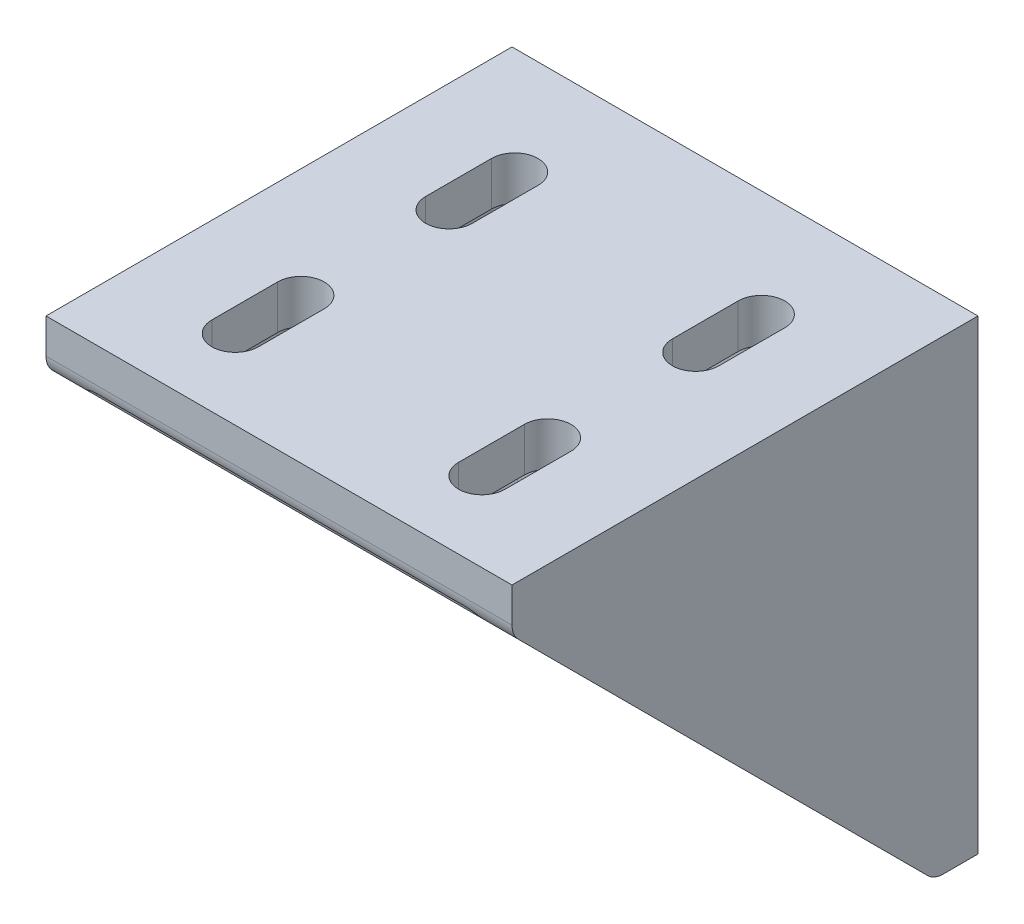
ISO-10303-21;
HEADER;
FILE_DESCRIPTION(('STEP AP214'),'2;1');
FILE_NAME('part.step','',(''),(''),'','','');
FILE_SCHEMA(('AUTOMOTIVE_DESIGN { 1 0 10303 214 1 1 1 1 }'));
ENDSEC;
DATA;
#1=APPLICATION_CONTEXT('core data for automotive mechanical design processes');
#2=APPLICATION_PROTOCOL_DEFINITION('international standard','automotive_design',2000,#1);
#3=PRODUCT_CONTEXT('',#1,'mechanical');
#4=PRODUCT('Part','Part','',(#3));
#5=PRODUCT_RELATED_PRODUCT_CATEGORY('part','',(#4));
#6=PRODUCT_DEFINITION_FORMATION('','',#4);
#7=PRODUCT_DEFINITION_CONTEXT('part definition',#1,'design');
#8=PRODUCT_DEFINITION('design','',#6,#7);
#9=PRODUCT_DEFINITION_SHAPE('','',#8);
#10=(LENGTH_UNIT() NAMED_UNIT(*) SI_UNIT(.MILLI.,.METRE.));
#11=(NAMED_UNIT(*) PLANE_ANGLE_UNIT() SI_UNIT($,.RADIAN.));
#12=(NAMED_UNIT(*) SI_UNIT($,.STERADIAN.) SOLID_ANGLE_UNIT());
#13=UNCERTAINTY_MEASURE_WITH_UNIT(LENGTH_MEASURE(1.E-05),#10,'distance_accuracy_value','');
#14=(GEOMETRIC_REPRESENTATION_CONTEXT(3) GLOBAL_UNCERTAINTY_ASSIGNED_CONTEXT((#13)) GLOBAL_UNIT_ASSIGNED_CONTEXT((#10,
#11,#12)) REPRESENTATION_CONTEXT('',''));
#15=CARTESIAN_POINT('',(0.,0.,0.));
#16=DIRECTION('',(0.,0.,1.));
#17=DIRECTION('',(1.,0.,0.));
#18=AXIS2_PLACEMENT_3D('',#15,#16,#17);
#19=CARTESIAN_POINT('',(-37.5,-22.26253388,11.67282651));
#20=DIRECTION('',(0.,-0.74314482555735,-0.669130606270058));
#21=DIRECTION('',(0.,0.669130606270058,-0.74314482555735));
#22=AXIS2_PLACEMENT_3D('',#19,#20,#21);
#23=PLANE('',#22);
#24=DIRECTION('',(-1.,0.,0.));
#25=VECTOR('',#24,1.);
#26=CARTESIAN_POINT('',(-37.5,-48.95963409,41.32296012));
#27=LINE('',#26,#25);
#28=CARTESIAN_POINT('',(-37.5,-48.9596340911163,41.3229601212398));
#29=VERTEX_POINT('',#28);
#30=CARTESIAN_POINT('',(-35.5,-48.9596340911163,41.3229601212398));
#31=VERTEX_POINT('',#30);
#32=EDGE_CURVE('E556',#29,#31,#27,.F.);
#33=ORIENTED_EDGE('',*,*,#32,.F.);
#34=DIRECTION('',(0.,-0.669130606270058,0.74314482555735));
#35=VECTOR('',#34,1.);
#36=CARTESIAN_POINT('',(-37.5,-22.5571222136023,12.0000000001));
#37=LINE('',#36,#35);
#38=CARTESIAN_POINT('',(-37.499999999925,-22.5571222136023,12.0000000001));
#39=VERTEX_POINT('',#38);
#40=EDGE_CURVE('E553',#39,#29,#37,.T.);
#41=ORIENTED_EDGE('',*,*,#40,.F.);
#42=CARTESIAN_POINT('',(-33.4999999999,-22.5571222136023,12.0000000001));
#43=DIRECTION('',(0.,-0.74314482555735,-0.669130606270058));
#44=DIRECTION('',(0.,-0.669130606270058,0.74314482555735));
#45=AXIS2_PLACEMENT_3D('',#42,#43,#44);
#46=ELLIPSE('',#45,5.38253091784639,4.);
#47=CARTESIAN_POINT('',(-37.4865972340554,-22.26253388,11.67282651));
#48=VERTEX_POINT('',#47);
#49=EDGE_CURVE('E21',#39,#48,#46,.T.);
#50=ORIENTED_EDGE('',*,*,#49,.T.);
#51=DIRECTION('',(-1.,0.,0.));
#52=VECTOR('',#51,1.);
#53=CARTESIAN_POINT('',(-37.5,-22.26253388,11.67282651));
#54=LINE('',#53,#52);
#55=CARTESIAN_POINT('',(-35.5,-22.2625338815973,11.672826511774));
#56=VERTEX_POINT('',#55);
#57=EDGE_CURVE('E551',#48,#56,#54,.F.);
#58=ORIENTED_EDGE('',*,*,#57,.T.);
#59=DIRECTION('',(0.,0.669130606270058,-0.74314482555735));
#60=VECTOR('',#59,1.);
#61=CARTESIAN_POINT('',(-35.5,-48.95963409,41.32296012));
#62=LINE('',#61,#60);
#63=EDGE_CURVE('E929',#31,#56,#62,.T.);
#64=ORIENTED_EDGE('',*,*,#63,.F.);
#65=EDGE_LOOP('',(#33,#41,#50,#58,#64));
#66=FACE_BOUND('',#65,.T.);
#67=ADVANCED_FACE('F18',(#66),#23,.T.);
#68=CARTESIAN_POINT('',(-37.5,-47.844916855,42.3266560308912));
#69=DIRECTION('',(-1.,0.,0.));
#70=DIRECTION('',(0.,0.,1.));
#71=AXIS2_PLACEMENT_3D('',#68,#69,#70);
#72=CYLINDRICAL_SURFACE('',#71,1.49999999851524);
#73=CARTESIAN_POINT('',(-37.5,-47.844916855,42.3266560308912));
#74=DIRECTION('',(-1.,0.,0.));
#75=DIRECTION('',(0.,0.,1.));
#76=AXIS2_PLACEMENT_3D('',#73,#74,#75);
#77=CIRCLE('',#76,1.49999999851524);
#78=CARTESIAN_POINT('',(-37.5,-46.802929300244,43.4056657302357));
#79=VERTEX_POINT('',#78);
#80=EDGE_CURVE('E903',#29,#79,#77,.T.);
#81=ORIENTED_EDGE('',*,*,#80,.F.);
#82=ORIENTED_EDGE('',*,*,#32,.T.);
#83=CARTESIAN_POINT('',(-35.5,-47.844916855,42.3266560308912));
#84=DIRECTION('',(-1.,0.,0.));
#85=DIRECTION('',(0.,0.,1.));
#86=AXIS2_PLACEMENT_3D('',#83,#84,#85);
#87=CIRCLE('',#86,1.49999999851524);
#88=CARTESIAN_POINT('',(-35.5,-46.802929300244,43.4056657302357));
#89=VERTEX_POINT('',#88);
#90=EDGE_CURVE('E932',#89,#31,#87,.F.);
#91=ORIENTED_EDGE('',*,*,#90,.F.);
#92=DIRECTION('',(1.,0.,0.));
#93=VECTOR('',#92,1.);
#94=CARTESIAN_POINT('',(-37.5,-46.8029293,43.40566573));
#95=LINE('',#94,#93);
#96=EDGE_CURVE('E982',#79,#89,#95,.T.);
#97=ORIENTED_EDGE('',*,*,#96,.F.);
#98=EDGE_LOOP('',(#81,#82,#91,#97));
#99=FACE_BOUND('',#98,.T.);
#100=ADVANCED_FACE('F618',(#99),#72,.T.);
#101=CARTESIAN_POINT('',(-37.5,-46.8029293,43.40566573));
#102=DIRECTION('',(0.,0.694658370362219,0.719339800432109));
#103=DIRECTION('',(0.,-0.719339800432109,0.694658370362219));
#104=AXIS2_PLACEMENT_3D('',#101,#102,#103);
#105=PLANE('',#104);
#106=DIRECTION('',(0.,0.719339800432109,-0.694658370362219));
#107=VECTOR('',#106,1.);
#108=CARTESIAN_POINT('',(-37.5,-46.8029293,43.40566573));
#109=LINE('',#108,#107);
#110=CARTESIAN_POINT('',(-37.5,-30.2116472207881,27.3836508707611));
#111=VERTEX_POINT('',#110);
#112=EDGE_CURVE('E900',#79,#111,#109,.T.);
#113=ORIENTED_EDGE('',*,*,#112,.F.);
#114=ORIENTED_EDGE('',*,*,#96,.T.);
#115=DIRECTION('',(0.,-0.719339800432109,0.694658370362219));
#116=VECTOR('',#115,1.);
#117=CARTESIAN_POINT('',(-35.5,-30.21164722,27.38365087));
#118=LINE('',#117,#116);
#119=CARTESIAN_POINT('',(-35.5,-30.2116472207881,27.3836508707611));
#120=VERTEX_POINT('',#119);
#121=EDGE_CURVE('E933',#120,#89,#118,.T.);
#122=ORIENTED_EDGE('',*,*,#121,.F.);
#123=DIRECTION('',(-1.,0.,0.));
#124=VECTOR('',#123,1.);
#125=CARTESIAN_POINT('',(-37.5,-30.21164722,27.38365087));
#126=LINE('',#125,#124);
#127=EDGE_CURVE('E979',#120,#111,#126,.T.);
#128=ORIENTED_EDGE('',*,*,#127,.T.);
#129=EDGE_LOOP('',(#113,#114,#122,#128));
#130=FACE_BOUND('',#129,.T.);
#131=ADVANCED_FACE('F615',(#130),#105,.T.);
#132=CARTESIAN_POINT('',(-37.5,-28.8223304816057,28.8223304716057));
#133=DIRECTION('',(-1.,0.,0.));
#134=DIRECTION('',(0.,0.,1.));
#135=AXIS2_PLACEMENT_3D('',#132,#133,#134);
#136=CYLINDRICAL_SURFACE('',#135,1.99999999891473);
#137=DIRECTION('',(1.,0.,0.));
#138=VECTOR('',#137,1.);
#139=CARTESIAN_POINT('',(-37.5,-27.38365088,30.21164721));
#140=LINE('',#139,#138);
#141=CARTESIAN_POINT('',(-37.5,-27.3836508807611,30.2116472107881));
#142=VERTEX_POINT('',#141);
#143=CARTESIAN_POINT('',(-35.5,-27.3836508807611,30.2116472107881));
#144=VERTEX_POINT('',#143);
#145=EDGE_CURVE('E977',#142,#144,#140,.T.);
#146=ORIENTED_EDGE('',*,*,#145,.F.);
#147=CARTESIAN_POINT('',(-37.5,-28.8223304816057,28.8223304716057));
#148=DIRECTION('',(-1.,0.,0.));
#149=DIRECTION('',(0.,0.,1.));
#150=AXIS2_PLACEMENT_3D('',#147,#148,#149);
#151=CIRCLE('',#150,1.99999999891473);
#152=EDGE_CURVE('E899',#111,#142,#151,.F.);
#153=ORIENTED_EDGE('',*,*,#152,.F.);
#154=ORIENTED_EDGE('',*,*,#127,.F.);
#155=CARTESIAN_POINT('',(-35.5,-28.8223304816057,28.8223304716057));
#156=DIRECTION('',(-1.,0.,0.));
#157=DIRECTION('',(0.,0.,1.));
#158=AXIS2_PLACEMENT_3D('',#155,#156,#157);
#159=CIRCLE('',#158,1.99999999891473);
#160=EDGE_CURVE('E937',#144,#120,#159,.T.);
#161=ORIENTED_EDGE('',*,*,#160,.F.);
#162=EDGE_LOOP('',(#146,#153,#154,#161));
#163=FACE_BOUND('',#162,.T.);
#164=ADVANCED_FACE('F611',(#163),#136,.F.);
#165=CARTESIAN_POINT('',(-37.5,-27.38365088,30.21164721));
#166=DIRECTION('',(0.,-0.719339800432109,-0.694658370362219));
#167=DIRECTION('',(0.,0.694658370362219,-0.719339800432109));
#168=AXIS2_PLACEMENT_3D('',#165,#166,#167);
#169=PLANE('',#168);
#170=DIRECTION('',(0.,-0.694658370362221,0.719339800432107));
#171=VECTOR('',#170,1.);
#172=CARTESIAN_POINT('',(-37.5,-27.38365088,30.21164721));
#173=LINE('',#172,#171);
#174=CARTESIAN_POINT('',(-37.5,-43.4056657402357,46.802929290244));
#175=VERTEX_POINT('',#174);
#176=EDGE_CURVE('E896',#142,#175,#173,.T.);
#177=ORIENTED_EDGE('',*,*,#176,.F.);
#178=ORIENTED_EDGE('',*,*,#145,.T.);
#179=DIRECTION('',(0.,0.694658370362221,-0.719339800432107));
#180=VECTOR('',#179,1.);
#181=CARTESIAN_POINT('',(-35.5,-43.4056657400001,46.80292929));
#182=LINE('',#181,#180);
#183=CARTESIAN_POINT('',(-35.5,-43.4056657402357,46.802929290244));
#184=VERTEX_POINT('',#183);
#185=EDGE_CURVE('E938',#184,#144,#182,.T.);
#186=ORIENTED_EDGE('',*,*,#185,.F.);
#187=DIRECTION('',(-1.,0.,0.));
#188=VECTOR('',#187,1.);
#189=CARTESIAN_POINT('',(-37.5,-43.4056657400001,46.80292929));
#190=LINE('',#189,#188);
#191=EDGE_CURVE('E974',#175,#184,#190,.F.);
#192=ORIENTED_EDGE('',*,*,#191,.F.);
#193=EDGE_LOOP('',(#177,#178,#186,#192));
#194=FACE_BOUND('',#193,.T.);
#195=ADVANCED_FACE('F607',(#194),#169,.T.);
#196=CARTESIAN_POINT('',(-37.5,-42.3266560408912,47.8449168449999));
#197=DIRECTION('',(-1.,0.,0.));
#198=DIRECTION('',(0.,0.,1.));
#199=AXIS2_PLACEMENT_3D('',#196,#197,#198);
#200=CYLINDRICAL_SURFACE('',#199,1.49999999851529);
#201=CARTESIAN_POINT('',(-37.5,-42.3266560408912,47.8449168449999));
#202=DIRECTION('',(-1.,0.,0.));
#203=DIRECTION('',(0.,0.,1.));
#204=AXIS2_PLACEMENT_3D('',#201,#202,#203);
#205=CIRCLE('',#204,1.49999999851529);
#206=CARTESIAN_POINT('',(-37.5,-41.3229601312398,48.9596340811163));
#207=VERTEX_POINT('',#206);
#208=EDGE_CURVE('E589',#175,#207,#205,.T.);
#209=ORIENTED_EDGE('',*,*,#208,.F.);
#210=ORIENTED_EDGE('',*,*,#191,.T.);
#211=CARTESIAN_POINT('',(-35.5,-42.3266560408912,47.8449168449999));
#212=DIRECTION('',(-1.,0.,0.));
#213=DIRECTION('',(0.,0.,1.));
#214=AXIS2_PLACEMENT_3D('',#211,#212,#213);
#215=CIRCLE('',#214,1.49999999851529);
#216=CARTESIAN_POINT('',(-35.5,-41.3229601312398,48.9596340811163));
#217=VERTEX_POINT('',#216);
#218=EDGE_CURVE('E942',#217,#184,#215,.F.);
#219=ORIENTED_EDGE('',*,*,#218,.F.);
#220=DIRECTION('',(1.,0.,0.));
#221=VECTOR('',#220,1.);
#222=CARTESIAN_POINT('',(-37.5,-41.32296013,48.95963408));
#223=LINE('',#222,#221);
#224=EDGE_CURVE('E564',#207,#217,#223,.T.);
#225=ORIENTED_EDGE('',*,*,#224,.F.);
#226=EDGE_LOOP('',(#209,#210,#219,#225));
#227=FACE_BOUND('',#226,.T.);
#228=ADVANCED_FACE('F603',(#227),#200,.T.);
#229=CARTESIAN_POINT('',(-37.5,-41.32296013,48.95963408));
#230=DIRECTION('',(0.,0.669130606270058,0.74314482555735));
#231=DIRECTION('',(0.,-0.74314482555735,0.669130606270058));
#232=AXIS2_PLACEMENT_3D('',#229,#230,#231);
#233=PLANE('',#232);
#234=DIRECTION('',(0.,-0.74314482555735,0.669130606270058));
#235=VECTOR('',#234,1.);
#236=CARTESIAN_POINT('',(-35.5,-11.67282652,22.26253387));
#237=LINE('',#236,#235);
#238=CARTESIAN_POINT('',(-35.5,-11.6728265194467,22.2625338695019));
#239=VERTEX_POINT('',#238);
#240=EDGE_CURVE('E943',#239,#217,#237,.T.);
#241=ORIENTED_EDGE('',*,*,#240,.F.);
#242=DIRECTION('',(-1.,0.,0.));
#243=VECTOR('',#242,1.);
#244=CARTESIAN_POINT('',(-37.5,-11.67282652,22.26253387));
#245=LINE('',#244,#243);
#246=CARTESIAN_POINT('',(-37.4865972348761,-11.67282652,22.26253387));
#247=VERTEX_POINT('',#246);
#248=EDGE_CURVE('E948',#239,#247,#245,.T.);
#249=ORIENTED_EDGE('',*,*,#248,.T.);
#250=CARTESIAN_POINT('',(-33.4999999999,-12.0000000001,22.5571221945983));
#251=DIRECTION('',(0.,0.669130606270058,0.74314482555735));
#252=DIRECTION('',(0.,-0.74314482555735,0.669130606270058));
#253=AXIS2_PLACEMENT_3D('',#250,#251,#252);
#254=ELLIPSE('',#253,5.38253091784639,4.);
#255=CARTESIAN_POINT('',(-37.499999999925,-12.0000000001,22.5571221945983));
#256=VERTEX_POINT('',#255);
#257=EDGE_CURVE('E973',#247,#256,#254,.T.);
#258=ORIENTED_EDGE('',*,*,#257,.T.);
#259=DIRECTION('',(0.,0.743144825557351,-0.669130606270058));
#260=VECTOR('',#259,1.);
#261=CARTESIAN_POINT('',(-37.5,-41.32296013,48.95963408));
#262=LINE('',#261,#260);
#263=EDGE_CURVE('E579',#207,#256,#262,.T.);
#264=ORIENTED_EDGE('',*,*,#263,.F.);
#265=ORIENTED_EDGE('',*,*,#224,.T.);
#266=EDGE_LOOP('',(#241,#249,#258,#264,#265));
#267=FACE_BOUND('',#266,.T.);
#268=ADVANCED_FACE('F599',(#267),#233,.T.);
#269=CARTESIAN_POINT('',(-37.5,-24.1203959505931,9.99999999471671));
#270=DIRECTION('',(-1.,0.,0.));
#271=DIRECTION('',(0.,0.,1.));
#272=AXIS2_PLACEMENT_3D('',#269,#270,#271);
#273=CYLINDRICAL_SURFACE('',#272,2.50000000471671);
#274=CARTESIAN_POINT('',(-35.5,-24.1203959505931,9.99999999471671));
#275=DIRECTION('',(-1.,0.,0.));
#276=DIRECTION('',(0.,0.,1.));
#277=AXIS2_PLACEMENT_3D('',#274,#275,#276);
#278=CIRCLE('',#277,2.50000000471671);
#279=CARTESIAN_POINT('',(-35.5,-22.0939689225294,8.53589838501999));
#280=VERTEX_POINT('',#279);
#281=EDGE_CURVE('E561',#56,#280,#278,.T.);
#282=ORIENTED_EDGE('',*,*,#281,.F.);
#283=ORIENTED_EDGE('',*,*,#57,.F.);
#284=CARTESIAN_POINT('',(-37.4865972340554,-22.26253388,11.67282651));
#285=CARTESIAN_POINT('',(-37.4827550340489,-22.2203170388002,11.6259549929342));
#286=CARTESIAN_POINT('',(-37.4779428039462,-22.179925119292,11.5775123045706));
#287=CARTESIAN_POINT('',(-37.4660941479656,-22.1030193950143,11.4778835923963));
#288=CARTESIAN_POINT('',(-37.4590572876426,-22.0665063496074,11.4266970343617));
#289=CARTESIAN_POINT('',(-37.4424921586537,-21.9976683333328,11.3220970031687));
#290=CARTESIAN_POINT('',(-37.4329686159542,-21.9653355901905,11.2686879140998));
#291=CARTESIAN_POINT('',(-37.4112106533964,-21.9049629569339,11.1600541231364));
#292=CARTESIAN_POINT('',(-37.3989765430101,-21.8769225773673,11.1048296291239));
#293=CARTESIAN_POINT('',(-37.3578665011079,-21.7993412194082,10.9369445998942));
#294=CARTESIAN_POINT('',(-37.3245998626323,-21.756415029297,10.8221875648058));
#295=CARTESIAN_POINT('',(-37.2458850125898,-21.6884616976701,10.591742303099));
#296=CARTESIAN_POINT('',(-37.2004426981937,-21.6634259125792,10.4760545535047));
#297=CARTESIAN_POINT('',(-37.0981377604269,-21.6300936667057,10.2481671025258));
#298=CARTESIAN_POINT('',(-37.0413375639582,-21.6217083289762,10.1359520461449));
#299=CARTESIAN_POINT('',(-36.9173336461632,-21.6193670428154,9.91729041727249));
#300=CARTESIAN_POINT('',(-36.8501221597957,-21.6254219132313,9.8108482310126));
#301=CARTESIAN_POINT('',(-36.6758211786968,-21.6547191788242,9.56152450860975));
#302=CARTESIAN_POINT('',(-36.564018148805,-21.684237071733,9.42267550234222));
#303=CARTESIAN_POINT('',(-36.3257065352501,-21.7606534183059,9.16334776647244));
#304=CARTESIAN_POINT('',(-36.1991566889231,-21.8076014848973,9.04292287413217));
#305=CARTESIAN_POINT('',(-35.9770543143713,-21.8953940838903,8.8570847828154));
#306=CARTESIAN_POINT('',(-35.8846321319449,-21.9333408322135,8.78643962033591));
#307=CARTESIAN_POINT('',(-35.695523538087,-22.0120048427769,8.65443121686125));
#308=CARTESIAN_POINT('',(-35.5988705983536,-22.0527013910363,8.59300782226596));
#309=CARTESIAN_POINT('',(-35.5,-22.0939689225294,8.53589838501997));
#310=B_SPLINE_CURVE_WITH_KNOTS('',3,(#284,#285,#286,#287,#288,#289,#290,#291,#292,#293,#294,
#295,#296,#297,#298,#299,#300,#301,#302,#303,#304,#305,#306,#307,#308,#309),.UNSPECIFIED.,.F.,
.F.,(4,2,2,2,2,2,2,2,2,2,2,2,4),(0.,0.189547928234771,0.379132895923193,0.568360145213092,
0.757565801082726,1.13638679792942,1.51502464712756,1.89163590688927,2.26852941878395,
2.80762582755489,3.3482686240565,3.71492846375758,4.07908165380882),.UNSPECIFIED.);
#311=EDGE_CURVE('E560',#48,#280,#310,.T.);
#312=ORIENTED_EDGE('',*,*,#311,.T.);
#313=EDGE_LOOP('',(#282,#283,#312));
#314=FACE_BOUND('',#313,.T.);
#315=ADVANCED_FACE('F559',(#314),#273,.F.);
#316=CARTESIAN_POINT('',(37.5,-11.67282652,22.26253387));
#317=DIRECTION('',(0.,0.669130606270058,0.74314482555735));
#318=DIRECTION('',(0.,-0.74314482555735,0.669130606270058));
#319=AXIS2_PLACEMENT_3D('',#316,#317,#318);
#320=PLANE('',#319);
#321=DIRECTION('',(1.,0.,0.));
#322=VECTOR('',#321,1.);
#323=CARTESIAN_POINT('',(37.5,-41.32296013,48.95963408));
#324=LINE('',#323,#322);
#325=CARTESIAN_POINT('',(37.5,-41.3229601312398,48.9596340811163));
#326=VERTEX_POINT('',#325);
#327=CARTESIAN_POINT('',(35.5,-41.3229601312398,48.9596340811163));
#328=VERTEX_POINT('',#327);
#329=EDGE_CURVE('E819',#326,#328,#324,.F.);
#330=ORIENTED_EDGE('',*,*,#329,.F.);
#331=DIRECTION('',(0.,-0.743144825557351,0.669130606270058));
#332=VECTOR('',#331,1.);
#333=CARTESIAN_POINT('',(37.5,-12.0000000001,22.5571221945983));
#334=LINE('',#333,#332);
#335=CARTESIAN_POINT('',(37.499999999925,-12.0000000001,22.5571221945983));
#336=VERTEX_POINT('',#335);
#337=EDGE_CURVE('E826',#336,#326,#334,.T.);
#338=ORIENTED_EDGE('',*,*,#337,.F.);
#339=CARTESIAN_POINT('',(33.4999999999,-12.0000000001,22.5571221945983));
#340=DIRECTION('',(0.,0.669130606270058,0.74314482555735));
#341=DIRECTION('',(0.,-0.74314482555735,0.669130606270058));
#342=AXIS2_PLACEMENT_3D('',#339,#340,#341);
#343=ELLIPSE('',#342,5.38253091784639,4.);
#344=CARTESIAN_POINT('',(37.4865972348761,-11.67282652,22.26253387));
#345=VERTEX_POINT('',#344);
#346=EDGE_CURVE('E563',#336,#345,#343,.T.);
#347=ORIENTED_EDGE('',*,*,#346,.T.);
#348=DIRECTION('',(1.,0.,0.));
#349=VECTOR('',#348,1.);
#350=CARTESIAN_POINT('',(37.5,-11.67282652,22.26253387));
#351=LINE('',#350,#349);
#352=CARTESIAN_POINT('',(35.5,-11.6728265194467,22.2625338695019));
#353=VERTEX_POINT('',#352);
#354=EDGE_CURVE('E926',#345,#353,#351,.F.);
#355=ORIENTED_EDGE('',*,*,#354,.T.);
#356=DIRECTION('',(0.,-0.74314482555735,0.669130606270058));
#357=VECTOR('',#356,1.);
#358=CARTESIAN_POINT('',(35.5,-11.67282652,22.26253387));
#359=LINE('',#358,#357);
#360=EDGE_CURVE('E921',#353,#328,#359,.T.);
#361=ORIENTED_EDGE('',*,*,#360,.T.);
#362=EDGE_LOOP('',(#330,#338,#347,#355,#361));
#363=FACE_BOUND('',#362,.T.);
#364=ADVANCED_FACE('F598',(#363),#320,.T.);
#365=CARTESIAN_POINT('',(37.5,-42.3266560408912,47.8449168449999));
#366=DIRECTION('',(1.,0.,0.));
#367=DIRECTION('',(0.,0.,-1.));
#368=AXIS2_PLACEMENT_3D('',#365,#366,#367);
#369=CYLINDRICAL_SURFACE('',#368,1.49999999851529);
#370=CARTESIAN_POINT('',(37.5,-42.3266560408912,47.8449168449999));
#371=DIRECTION('',(1.,0.,0.));
#372=DIRECTION('',(0.,0.,-1.));
#373=AXIS2_PLACEMENT_3D('',#370,#371,#372);
#374=CIRCLE('',#373,1.49999999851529);
#375=CARTESIAN_POINT('',(37.5,-43.4056657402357,46.802929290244));
#376=VERTEX_POINT('',#375);
#377=EDGE_CURVE('E816',#326,#376,#374,.T.);
#378=ORIENTED_EDGE('',*,*,#377,.F.);
#379=ORIENTED_EDGE('',*,*,#329,.T.);
#380=CARTESIAN_POINT('',(35.5,-42.3266560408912,47.8449168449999));
#381=DIRECTION('',(1.,0.,0.));
#382=DIRECTION('',(0.,0.,-1.));
#383=AXIS2_PLACEMENT_3D('',#380,#381,#382);
#384=CIRCLE('',#383,1.49999999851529);
#385=CARTESIAN_POINT('',(35.5,-43.4056657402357,46.802929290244));
#386=VERTEX_POINT('',#385);
#387=EDGE_CURVE('E920',#328,#386,#384,.T.);
#388=ORIENTED_EDGE('',*,*,#387,.T.);
#389=DIRECTION('',(1.,0.,0.));
#390=VECTOR('',#389,1.);
#391=CARTESIAN_POINT('',(37.5,-43.4056657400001,46.80292929));
#392=LINE('',#391,#390);
#393=EDGE_CURVE('E821',#376,#386,#392,.F.);
#394=ORIENTED_EDGE('',*,*,#393,.F.);
#395=EDGE_LOOP('',(#378,#379,#388,#394));
#396=FACE_BOUND('',#395,.T.);
#397=ADVANCED_FACE('F806',(#396),#369,.T.);
#398=CARTESIAN_POINT('',(37.5,-43.4056657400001,46.80292929));
#399=DIRECTION('',(0.,-0.719339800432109,-0.694658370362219));
#400=DIRECTION('',(0.,0.694658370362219,-0.719339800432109));
#401=AXIS2_PLACEMENT_3D('',#398,#399,#400);
#402=PLANE('',#401);
#403=DIRECTION('',(0.,0.694658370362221,-0.719339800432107));
#404=VECTOR('',#403,1.);
#405=CARTESIAN_POINT('',(37.5,-43.4056657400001,46.80292929));
#406=LINE('',#405,#404);
#407=CARTESIAN_POINT('',(37.5,-27.3836508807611,30.2116472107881));
#408=VERTEX_POINT('',#407);
#409=EDGE_CURVE('E825',#376,#408,#406,.T.);
#410=ORIENTED_EDGE('',*,*,#409,.F.);
#411=ORIENTED_EDGE('',*,*,#393,.T.);
#412=DIRECTION('',(0.,0.694658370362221,-0.719339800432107));
#413=VECTOR('',#412,1.);
#414=CARTESIAN_POINT('',(35.5,-43.4056657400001,46.80292929));
#415=LINE('',#414,#413);
#416=CARTESIAN_POINT('',(35.5,-27.3836508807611,30.2116472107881));
#417=VERTEX_POINT('',#416);
#418=EDGE_CURVE('E916',#386,#417,#415,.T.);
#419=ORIENTED_EDGE('',*,*,#418,.T.);
#420=DIRECTION('',(1.,0.,0.));
#421=VECTOR('',#420,1.);
#422=CARTESIAN_POINT('',(37.5,-27.38365088,30.21164721));
#423=LINE('',#422,#421);
#424=EDGE_CURVE('E964',#417,#408,#423,.T.);
#425=ORIENTED_EDGE('',*,*,#424,.T.);
#426=EDGE_LOOP('',(#410,#411,#419,#425));
#427=FACE_BOUND('',#426,.T.);
#428=ADVANCED_FACE('F803',(#427),#402,.T.);
#429=CARTESIAN_POINT('',(37.5,-28.8223304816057,28.8223304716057));
#430=DIRECTION('',(1.,0.,0.));
#431=DIRECTION('',(0.,0.,-1.));
#432=AXIS2_PLACEMENT_3D('',#429,#430,#431);
#433=CYLINDRICAL_SURFACE('',#432,1.99999999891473);
#434=DIRECTION('',(1.,0.,0.));
#435=VECTOR('',#434,1.);
#436=CARTESIAN_POINT('',(37.5,-30.21164722,27.38365087));
#437=LINE('',#436,#435);
#438=CARTESIAN_POINT('',(37.5,-30.2116472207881,27.3836508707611));
#439=VERTEX_POINT('',#438);
#440=CARTESIAN_POINT('',(35.5,-30.2116472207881,27.3836508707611));
#441=VERTEX_POINT('',#440);
#442=EDGE_CURVE('E961',#439,#441,#437,.F.);
#443=ORIENTED_EDGE('',*,*,#442,.F.);
#444=CARTESIAN_POINT('',(37.5,-28.8223304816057,28.8223304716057));
#445=DIRECTION('',(1.,0.,0.));
#446=DIRECTION('',(0.,0.,-1.));
#447=AXIS2_PLACEMENT_3D('',#444,#445,#446);
#448=CIRCLE('',#447,1.99999999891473);
#449=EDGE_CURVE('E830',#408,#439,#448,.F.);
#450=ORIENTED_EDGE('',*,*,#449,.F.);
#451=ORIENTED_EDGE('',*,*,#424,.F.);
#452=CARTESIAN_POINT('',(35.5,-28.8223304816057,28.8223304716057));
#453=DIRECTION('',(1.,0.,0.));
#454=DIRECTION('',(0.,0.,-1.));
#455=AXIS2_PLACEMENT_3D('',#452,#453,#454);
#456=CIRCLE('',#455,1.99999999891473);
#457=EDGE_CURVE('E915',#417,#441,#456,.F.);
#458=ORIENTED_EDGE('',*,*,#457,.T.);
#459=EDGE_LOOP('',(#443,#450,#451,#458));
#460=FACE_BOUND('',#459,.T.);
#461=ADVANCED_FACE('F799',(#460),#433,.F.);
#462=CARTESIAN_POINT('',(37.5,-30.21164722,27.38365087));
#463=DIRECTION('',(0.,0.694658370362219,0.719339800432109));
#464=DIRECTION('',(0.,-0.719339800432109,0.694658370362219));
#465=AXIS2_PLACEMENT_3D('',#462,#463,#464);
#466=PLANE('',#465);
#467=DIRECTION('',(0.,-0.719339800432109,0.694658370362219));
#468=VECTOR('',#467,1.);
#469=CARTESIAN_POINT('',(37.5,-30.21164722,27.38365087));
#470=LINE('',#469,#468);
#471=CARTESIAN_POINT('',(37.5,-46.802929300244,43.4056657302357));
#472=VERTEX_POINT('',#471);
#473=EDGE_CURVE('E836',#439,#472,#470,.T.);
#474=ORIENTED_EDGE('',*,*,#473,.F.);
#475=ORIENTED_EDGE('',*,*,#442,.T.);
#476=DIRECTION('',(0.,-0.719339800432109,0.694658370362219));
#477=VECTOR('',#476,1.);
#478=CARTESIAN_POINT('',(35.5,-30.21164722,27.38365087));
#479=LINE('',#478,#477);
#480=CARTESIAN_POINT('',(35.5,-46.802929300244,43.4056657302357));
#481=VERTEX_POINT('',#480);
#482=EDGE_CURVE('E911',#441,#481,#479,.T.);
#483=ORIENTED_EDGE('',*,*,#482,.T.);
#484=DIRECTION('',(1.,0.,0.));
#485=VECTOR('',#484,1.);
#486=CARTESIAN_POINT('',(37.5,-46.8029293,43.40566573));
#487=LINE('',#486,#485);
#488=EDGE_CURVE('E959',#472,#481,#487,.F.);
#489=ORIENTED_EDGE('',*,*,#488,.F.);
#490=EDGE_LOOP('',(#474,#475,#483,#489));
#491=FACE_BOUND('',#490,.T.);
#492=ADVANCED_FACE('F795',(#491),#466,.T.);
#493=CARTESIAN_POINT('',(37.5,-47.844916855,42.3266560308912));
#494=DIRECTION('',(1.,0.,0.));
#495=DIRECTION('',(0.,0.,-1.));
#496=AXIS2_PLACEMENT_3D('',#493,#494,#495);
#497=CYLINDRICAL_SURFACE('',#496,1.49999999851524);
#498=CARTESIAN_POINT('',(37.5,-47.844916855,42.3266560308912));
#499=DIRECTION('',(1.,0.,0.));
#500=DIRECTION('',(0.,0.,-1.));
#501=AXIS2_PLACEMENT_3D('',#498,#499,#500);
#502=CIRCLE('',#501,1.49999999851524);
#503=CARTESIAN_POINT('',(37.5,-48.9596340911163,41.3229601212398));
#504=VERTEX_POINT('',#503);
#505=EDGE_CURVE('E837',#472,#504,#502,.T.);
#506=ORIENTED_EDGE('',*,*,#505,.F.);
#507=ORIENTED_EDGE('',*,*,#488,.T.);
#508=CARTESIAN_POINT('',(35.5,-47.844916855,42.3266560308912));
#509=DIRECTION('',(1.,0.,0.));
#510=DIRECTION('',(0.,0.,-1.));
#511=AXIS2_PLACEMENT_3D('',#508,#509,#510);
#512=CIRCLE('',#511,1.49999999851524);
#513=CARTESIAN_POINT('',(35.5,-48.9596340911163,41.3229601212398));
#514=VERTEX_POINT('',#513);
#515=EDGE_CURVE('E910',#481,#514,#512,.T.);
#516=ORIENTED_EDGE('',*,*,#515,.T.);
#517=DIRECTION('',(1.,0.,0.));
#518=VECTOR('',#517,1.);
#519=CARTESIAN_POINT('',(37.5,-48.95963409,41.32296012));
#520=LINE('',#519,#518);
#521=EDGE_CURVE('E956',#504,#514,#520,.F.);
#522=ORIENTED_EDGE('',*,*,#521,.F.);
#523=EDGE_LOOP('',(#506,#507,#516,#522));
#524=FACE_BOUND('',#523,.T.);
#525=ADVANCED_FACE('F791',(#524),#497,.T.);
#526=CARTESIAN_POINT('',(37.5,-48.95963409,41.32296012));
#527=DIRECTION('',(0.,-0.74314482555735,-0.669130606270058));
#528=DIRECTION('',(0.,0.669130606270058,-0.74314482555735));
#529=AXIS2_PLACEMENT_3D('',#526,#527,#528);
#530=PLANE('',#529);
#531=DIRECTION('',(0.,0.669130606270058,-0.74314482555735));
#532=VECTOR('',#531,1.);
#533=CARTESIAN_POINT('',(35.5,-48.95963409,41.32296012));
#534=LINE('',#533,#532);
#535=CARTESIAN_POINT('',(35.5,-22.2625338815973,11.672826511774));
#536=VERTEX_POINT('',#535);
#537=EDGE_CURVE('E907',#514,#536,#534,.T.);
#538=ORIENTED_EDGE('',*,*,#537,.T.);
#539=DIRECTION('',(1.,0.,0.));
#540=VECTOR('',#539,1.);
#541=CARTESIAN_POINT('',(37.5,-22.26253388,11.67282651));
#542=LINE('',#541,#540);
#543=CARTESIAN_POINT('',(37.4865972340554,-22.26253388,11.67282651));
#544=VERTEX_POINT('',#543);
#545=EDGE_CURVE('E952',#536,#544,#542,.T.);
#546=ORIENTED_EDGE('',*,*,#545,.T.);
#547=CARTESIAN_POINT('',(33.4999999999,-22.5571222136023,12.0000000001));
#548=DIRECTION('',(0.,-0.74314482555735,-0.669130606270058));
#549=DIRECTION('',(0.,-0.669130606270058,0.74314482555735));
#550=AXIS2_PLACEMENT_3D('',#547,#548,#549);
#551=ELLIPSE('',#550,5.38253091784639,4.);
#552=CARTESIAN_POINT('',(37.499999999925,-22.5571222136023,12.0000000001));
#553=VERTEX_POINT('',#552);
#554=EDGE_CURVE('E958',#544,#553,#551,.T.);
#555=ORIENTED_EDGE('',*,*,#554,.T.);
#556=DIRECTION('',(0.,0.669130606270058,-0.74314482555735));
#557=VECTOR('',#556,1.);
#558=CARTESIAN_POINT('',(37.5,-48.95963409,41.32296012));
#559=LINE('',#558,#557);
#560=EDGE_CURVE('E839',#504,#553,#559,.T.);
#561=ORIENTED_EDGE('',*,*,#560,.F.);
#562=ORIENTED_EDGE('',*,*,#521,.T.);
#563=EDGE_LOOP('',(#538,#546,#555,#561,#562));
#564=FACE_BOUND('',#563,.T.);
#565=ADVANCED_FACE('F787',(#564),#530,.T.);
#566=CARTESIAN_POINT('',(37.5,-24.1203959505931,9.99999999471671));
#567=DIRECTION('',(1.,0.,0.));
#568=DIRECTION('',(0.,0.,-1.));
#569=AXIS2_PLACEMENT_3D('',#566,#567,#568);
#570=CYLINDRICAL_SURFACE('',#569,2.50000000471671);
#571=ORIENTED_EDGE('',*,*,#545,.F.);
#572=CARTESIAN_POINT('',(35.5,-24.1203959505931,9.99999999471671));
#573=DIRECTION('',(1.,0.,0.));
#574=DIRECTION('',(0.,0.,-1.));
#575=AXIS2_PLACEMENT_3D('',#572,#573,#574);
#576=CIRCLE('',#575,2.50000000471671);
#577=CARTESIAN_POINT('',(35.5,-22.0939689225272,8.5358983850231));
#578=VERTEX_POINT('',#577);
#579=EDGE_CURVE('E906',#536,#578,#576,.F.);
#580=ORIENTED_EDGE('',*,*,#579,.T.);
#581=CARTESIAN_POINT('',(35.5,-22.0939689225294,8.53589838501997));
#582=CARTESIAN_POINT('',(35.5856761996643,-22.0582146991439,8.58538957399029));
#583=CARTESIAN_POINT('',(35.6696386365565,-22.0229025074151,8.63808169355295));
#584=CARTESIAN_POINT('',(35.8341234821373,-21.9542746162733,8.75010108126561));
#585=CARTESIAN_POINT('',(35.9146391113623,-21.9209628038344,8.8094406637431));
#586=CARTESIAN_POINT('',(36.1518682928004,-21.8253632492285,8.99855784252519));
#587=CARTESIAN_POINT('',(36.3027868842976,-21.7680662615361,9.13858983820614));
#588=CARTESIAN_POINT('',(36.54504392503,-21.6902761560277,9.40189804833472));
#589=CARTESIAN_POINT('',(36.6412540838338,-21.6639741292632,9.51894018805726));
#590=CARTESIAN_POINT('',(36.7757515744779,-21.6373011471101,9.7032125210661));
#591=CARTESIAN_POINT('',(36.8189030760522,-21.6305406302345,9.76600972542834));
#592=CARTESIAN_POINT('',(36.9016750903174,-21.6218107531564,9.8941942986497));
#593=CARTESIAN_POINT('',(36.9412971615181,-21.6198392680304,9.95958050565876));
#594=CARTESIAN_POINT('',(37.0171579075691,-21.6212320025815,10.0932807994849));
#595=CARTESIAN_POINT('',(37.0533504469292,-21.6246603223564,10.1616205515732));
#596=CARTESIAN_POINT('',(37.1214994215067,-21.6374681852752,10.2998021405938));
#597=CARTESIAN_POINT('',(37.1534581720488,-21.6468444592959,10.3696431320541));
#598=CARTESIAN_POINT('',(37.212955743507,-21.6719523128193,10.5101091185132));
#599=CARTESIAN_POINT('',(37.2404929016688,-21.6876862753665,10.5807343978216));
#600=CARTESIAN_POINT('',(37.2910203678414,-21.725746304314,10.7218023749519));
#601=CARTESIAN_POINT('',(37.3140116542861,-21.7480709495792,10.7922451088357));
#602=CARTESIAN_POINT('',(37.3699985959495,-21.8174293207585,10.9809781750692));
#603=CARTESIAN_POINT('',(37.3987439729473,-21.8708239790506,11.0982732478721));
#604=CARTESIAN_POINT('',(37.4442768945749,-21.9962719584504,11.3246967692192));
#605=CARTESIAN_POINT('',(37.4610841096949,-22.068294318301,11.4338383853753));
#606=CARTESIAN_POINT('',(37.4758143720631,-22.1667383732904,11.5601618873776));
#607=CARTESIAN_POINT('',(37.4782884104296,-22.185339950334,11.5831736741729));
#608=CARTESIAN_POINT('',(37.4827766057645,-22.2233385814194,11.6285092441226));
#609=CARTESIAN_POINT('',(37.4847915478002,-22.2427342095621,11.6508341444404));
#610=CARTESIAN_POINT('',(37.4865972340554,-22.26253388,11.67282651));
#611=B_SPLINE_CURVE_WITH_KNOTS('',3,(#581,#582,#583,#584,#585,#586,#587,#588,#589,#590,#591,
#592,#593,#594,#595,#596,#597,#598,#599,#600,#601,#602,#603,#604,#605,#606,#607,#608,#609,#610),
.UNSPECIFIED.,.F.,.F.,(4,2,2,2,2,2,2,2,2,2,2,2,2,2,4),(0.,0.315454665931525,0.631503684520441,
1.26901720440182,1.72857404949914,1.95781746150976,2.18695913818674,2.41884147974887,
2.65059648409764,2.88243843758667,3.11423043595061,3.50814725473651,3.90141350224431,
3.9904817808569,4.07939658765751),.UNSPECIFIED.);
#612=EDGE_CURVE('E770',#578,#544,#611,.T.);
#613=ORIENTED_EDGE('',*,*,#612,.T.);
#614=EDGE_LOOP('',(#571,#580,#613));
#615=FACE_BOUND('',#614,.T.);
#616=ADVANCED_FACE('F781',(#615),#570,.F.);
#617=CARTESIAN_POINT('',(-37.5,-10.0000000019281,24.12039593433));
#618=DIRECTION('',(-1.,0.,0.));
#619=DIRECTION('',(0.,0.,1.));
#620=AXIS2_PLACEMENT_3D('',#617,#618,#619);
#621=CYLINDRICAL_SURFACE('',#620,2.50000000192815);
#622=ORIENTED_EDGE('',*,*,#248,.F.);
#623=CARTESIAN_POINT('',(-35.5,-10.0000000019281,24.12039593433));
#624=DIRECTION('',(-1.,0.,0.));
#625=DIRECTION('',(0.,0.,1.));
#626=AXIS2_PLACEMENT_3D('',#623,#624,#625);
#627=CIRCLE('',#626,2.50000000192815);
#628=CARTESIAN_POINT('',(-35.5,-8.53589838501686,22.0939689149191));
#629=VERTEX_POINT('',#628);
#630=EDGE_CURVE('E947',#629,#239,#627,.T.);
#631=ORIENTED_EDGE('',*,*,#630,.F.);
#632=CARTESIAN_POINT('',(-35.5,-8.53589838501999,22.0939689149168));
#633=CARTESIAN_POINT('',(-35.5856761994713,-8.5853895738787,22.0582146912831));
#634=CARTESIAN_POINT('',(-35.6696386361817,-8.63808169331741,22.0229024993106));
#635=CARTESIAN_POINT('',(-35.8341234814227,-8.75010108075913,21.9542746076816));
#636=CARTESIAN_POINT('',(-35.9146391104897,-8.80944066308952,21.9209627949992));
#637=CARTESIAN_POINT('',(-36.1518682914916,-8.99855784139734,21.8253632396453));
#638=CARTESIAN_POINT('',(-36.3027868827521,-9.13858983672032,21.7680662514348));
#639=CARTESIAN_POINT('',(-36.5450439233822,-9.40189804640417,21.6902761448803));
#640=CARTESIAN_POINT('',(-36.641254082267,-9.51894018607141,21.6639741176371));
#641=CARTESIAN_POINT('',(-36.7757515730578,-9.70321251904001,21.6373011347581));
#642=CARTESIAN_POINT('',(-36.8189030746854,-9.76600972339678,21.6305406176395));
#643=CARTESIAN_POINT('',(-36.9016750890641,-9.89419429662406,21.6218107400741));
#644=CARTESIAN_POINT('',(-36.9412971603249,-9.95958050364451,21.6198392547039));
#645=CARTESIAN_POINT('',(-37.0171579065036,-10.0932807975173,21.6212319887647));
#646=CARTESIAN_POINT('',(-37.0533504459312,-10.1616205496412,21.6246603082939));
#647=CARTESIAN_POINT('',(-37.1214994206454,-10.2998021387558,21.6374681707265));
#648=CARTESIAN_POINT('',(-37.1534581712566,-10.3696431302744,21.6468444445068));
#649=CARTESIAN_POINT('',(-37.21295574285,-10.5101091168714,21.6719522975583));
#650=CARTESIAN_POINT('',(-37.2404929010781,-10.5807343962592,21.6876862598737));
#651=CARTESIAN_POINT('',(-37.2910203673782,-10.7218023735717,21.7257462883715));
#652=CARTESIAN_POINT('',(-37.3140116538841,-10.7922451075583,21.7480709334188));
#653=CARTESIAN_POINT('',(-37.3699985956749,-10.9809781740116,21.8174293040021));
#654=CARTESIAN_POINT('',(-37.3987439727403,-11.0982732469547,21.8708239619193));
#655=CARTESIAN_POINT('',(-37.4442768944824,-11.3246967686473,21.9962719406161));
#656=CARTESIAN_POINT('',(-37.4610841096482,-11.4338383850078,22.0682943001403));
#657=CARTESIAN_POINT('',(-37.4758143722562,-11.5601618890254,22.1667383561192));
#658=CARTESIAN_POINT('',(-37.4782884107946,-11.5831736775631,22.1853399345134));
#659=CARTESIAN_POINT('',(-37.4827766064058,-11.6285092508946,22.2233385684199));
#660=CARTESIAN_POINT('',(-37.484791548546,-11.6508341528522,22.2427341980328));
#661=CARTESIAN_POINT('',(-37.4865972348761,-11.67282652,22.26253387));
#662=B_SPLINE_CURVE_WITH_KNOTS('',3,(#632,#633,#634,#635,#636,#637,#638,#639,#640,#641,#642,
#643,#644,#645,#646,#647,#648,#649,#650,#651,#652,#653,#654,#655,#656,#657,#658,#659,#660,#661),
.UNSPECIFIED.,.F.,.F.,(4,2,2,2,2,2,2,2,2,2,2,2,2,2,4),(0.,0.315454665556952,0.63150368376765,
1.26901720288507,1.7285740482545,1.95781746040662,2.18695913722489,2.41884147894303,
2.65059648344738,2.88243843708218,3.11423043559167,3.50814725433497,3.90141350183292,
3.99048178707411,4.07939660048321),.UNSPECIFIED.);
#663=EDGE_CURVE('E757',#629,#247,#662,.T.);
#664=ORIENTED_EDGE('',*,*,#663,.T.);
#665=EDGE_LOOP('',(#622,#631,#664));
#666=FACE_BOUND('',#665,.T.);
#667=ADVANCED_FACE('F776',(#666),#621,.F.);
#668=CARTESIAN_POINT('',(-35.5,-28.7316361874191,28.7316361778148));
#669=DIRECTION('',(1.,0.,0.));
#670=DIRECTION('',(0.,0.,-1.));
#671=AXIS2_PLACEMENT_3D('',#668,#669,#670);
#672=PLANE('',#671);
#673=ORIENTED_EDGE('',*,*,#63,.T.);
#674=ORIENTED_EDGE('',*,*,#281,.T.);
#675=DIRECTION('',(0.,-1.,0.));
#676=VECTOR('',#675,1.);
#677=CARTESIAN_POINT('',(-35.5,-85.,8.53589838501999));
#678=LINE('',#677,#676);
#679=CARTESIAN_POINT('',(-35.5,-10.,8.53589838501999));
#680=VERTEX_POINT('',#679);
#681=EDGE_CURVE('E569',#280,#680,#678,.F.);
#682=ORIENTED_EDGE('',*,*,#681,.T.);
#683=CARTESIAN_POINT('',(-35.5,-12.0000000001,12.0000000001));
#684=DIRECTION('',(-1.,0.,0.));
#685=DIRECTION('',(0.,0.,1.));
#686=AXIS2_PLACEMENT_3D('',#683,#684,#685);
#687=CIRCLE('',#686,4.);
#688=CARTESIAN_POINT('',(-35.4999999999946,-8.53589838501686,10.0000000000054));
#689=VERTEX_POINT('',#688);
#690=EDGE_CURVE('E1717',#680,#689,#687,.F.);
#691=ORIENTED_EDGE('',*,*,#690,.T.);
#692=DIRECTION('',(0.,0.,1.));
#693=VECTOR('',#692,1.);
#694=CARTESIAN_POINT('',(-35.4999999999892,-8.53589838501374,85.));
#695=LINE('',#694,#693);
#696=EDGE_CURVE('E1306',#689,#629,#695,.T.);
#697=ORIENTED_EDGE('',*,*,#696,.T.);
#698=ORIENTED_EDGE('',*,*,#630,.T.);
#699=ORIENTED_EDGE('',*,*,#240,.T.);
#700=ORIENTED_EDGE('',*,*,#218,.T.);
#701=ORIENTED_EDGE('',*,*,#185,.T.);
#702=ORIENTED_EDGE('',*,*,#160,.T.);
#703=ORIENTED_EDGE('',*,*,#121,.T.);
#704=ORIENTED_EDGE('',*,*,#90,.T.);
#705=EDGE_LOOP('',(#673,#674,#682,#691,#697,#698,#699,#700,#701,#702,#703,#704));
#706=FACE_BOUND('',#705,.T.);
#707=ADVANCED_FACE('F780',(#706),#672,.T.);
#708=CARTESIAN_POINT('',(37.5,-10.0000000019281,24.12039593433));
#709=DIRECTION('',(1.,0.,0.));
#710=DIRECTION('',(0.,0.,-1.));
#711=AXIS2_PLACEMENT_3D('',#708,#709,#710);
#712=CYLINDRICAL_SURFACE('',#711,2.50000000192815);
#713=CARTESIAN_POINT('',(35.5,-10.0000000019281,24.12039593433));
#714=DIRECTION('',(1.,0.,0.));
#715=DIRECTION('',(0.,0.,-1.));
#716=AXIS2_PLACEMENT_3D('',#713,#714,#715);
#717=CIRCLE('',#716,2.50000000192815);
#718=CARTESIAN_POINT('',(35.5,-8.53589838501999,22.0939689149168));
#719=VERTEX_POINT('',#718);
#720=EDGE_CURVE('E925',#719,#353,#717,.F.);
#721=ORIENTED_EDGE('',*,*,#720,.T.);
#722=ORIENTED_EDGE('',*,*,#354,.F.);
#723=CARTESIAN_POINT('',(37.4865972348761,-11.67282652,22.26253387));
#724=CARTESIAN_POINT('',(37.4827550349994,-11.6259550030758,22.2203170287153));
#725=CARTESIAN_POINT('',(37.4779428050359,-11.5775123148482,22.1799251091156));
#726=CARTESIAN_POINT('',(37.4660941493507,-11.4778836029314,22.103019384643));
#727=CARTESIAN_POINT('',(37.4590572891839,-11.4266970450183,22.0665063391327));
#728=CARTESIAN_POINT('',(37.4424921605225,-11.3220970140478,21.9976683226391));
#729=CARTESIAN_POINT('',(37.4329686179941,-11.2686879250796,21.9653355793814));
#730=CARTESIAN_POINT('',(37.4112106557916,-11.1600541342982,21.9049629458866));
#731=CARTESIAN_POINT('',(37.3989765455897,-11.1048296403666,21.8769225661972));
#732=CARTESIAN_POINT('',(37.3578665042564,-10.9369446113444,21.7993412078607));
#733=CARTESIAN_POINT('',(37.3245998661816,-10.8221875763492,21.7564150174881));
#734=CARTESIAN_POINT('',(37.245885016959,-10.5917423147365,21.6884616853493));
#735=CARTESIAN_POINT('',(37.2004427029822,-10.4760545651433,21.6634259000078));
#736=CARTESIAN_POINT('',(37.0981377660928,-10.2481671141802,21.6300936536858));
#737=CARTESIAN_POINT('',(37.0413375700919,-10.1359520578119,21.6217083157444));
#738=CARTESIAN_POINT('',(36.9173336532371,-9.91729042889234,21.6193670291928));
#739=CARTESIAN_POINT('',(36.8501221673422,-9.81084824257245,21.6254218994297));
#740=CARTESIAN_POINT('',(36.6758211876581,-9.56152452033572,21.6547191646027));
#741=CARTESIAN_POINT('',(36.5640181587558,-9.42267551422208,21.6842370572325));
#742=CARTESIAN_POINT('',(36.3257065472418,-9.16334777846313,21.7606534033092));
#743=CARTESIAN_POINT('',(36.1991567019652,-9.04292288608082,21.807601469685));
#744=CARTESIAN_POINT('',(35.977054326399,-8.85708479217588,21.8953940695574));
#745=CARTESIAN_POINT('',(35.8846321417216,-8.78643962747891,21.9333408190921));
#746=CARTESIAN_POINT('',(35.6955235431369,-8.65443122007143,22.0120048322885));
#747=CARTESIAN_POINT('',(35.5988706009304,-8.5930078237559,22.0527013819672));
#748=CARTESIAN_POINT('',(35.5,-8.53589838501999,22.0939689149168));
#749=B_SPLINE_CURVE_WITH_KNOTS('',3,(#723,#724,#725,#726,#727,#728,#729,#730,#731,#732,#733,
#734,#735,#736,#737,#738,#739,#740,#741,#742,#743,#744,#745,#746,#747,#748),.UNSPECIFIED.,.F.,
.F.,(4,2,2,2,2,2,2,2,2,2,2,2,4),(0.,0.189547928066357,0.379132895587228,0.568360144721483,
0.757565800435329,1.13638679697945,1.51502464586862,1.89163590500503,2.26852941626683,
2.80762582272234,3.34826861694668,3.71492846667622,4.07908166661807),.UNSPECIFIED.);
#750=EDGE_CURVE('E1283',#345,#719,#749,.T.);
#751=ORIENTED_EDGE('',*,*,#750,.T.);
#752=EDGE_LOOP('',(#721,#722,#751));
#753=FACE_BOUND('',#752,.T.);
#754=ADVANCED_FACE('F1396',(#753),#712,.F.);
#755=CARTESIAN_POINT('',(35.5,-28.7316361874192,28.7316361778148));
#756=DIRECTION('',(1.,0.,0.));
#757=DIRECTION('',(0.,0.,-1.));
#758=AXIS2_PLACEMENT_3D('',#755,#756,#757);
#759=PLANE('',#758);
#760=CARTESIAN_POINT('',(35.5,-12.0000000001,12.0000000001));
#761=DIRECTION('',(-1.,0.,0.));
#762=DIRECTION('',(0.,0.,1.));
#763=AXIS2_PLACEMENT_3D('',#760,#761,#762);
#764=CIRCLE('',#763,4.);
#765=CARTESIAN_POINT('',(35.5,-8.53589838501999,9.99999999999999));
#766=VERTEX_POINT('',#765);
#767=CARTESIAN_POINT('',(35.5000000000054,-9.99999999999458,8.53589838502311));
#768=VERTEX_POINT('',#767);
#769=EDGE_CURVE('E1437',#766,#768,#764,.T.);
#770=ORIENTED_EDGE('',*,*,#769,.T.);
#771=DIRECTION('',(0.,-1.,0.));
#772=VECTOR('',#771,1.);
#773=CARTESIAN_POINT('',(35.5000000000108,-85.,8.53589838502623));
#774=LINE('',#773,#772);
#775=EDGE_CURVE('E767',#768,#578,#774,.T.);
#776=ORIENTED_EDGE('',*,*,#775,.T.);
#777=ORIENTED_EDGE('',*,*,#579,.F.);
#778=ORIENTED_EDGE('',*,*,#537,.F.);
#779=ORIENTED_EDGE('',*,*,#515,.F.);
#780=ORIENTED_EDGE('',*,*,#482,.F.);
#781=ORIENTED_EDGE('',*,*,#457,.F.);
#782=ORIENTED_EDGE('',*,*,#418,.F.);
#783=ORIENTED_EDGE('',*,*,#387,.F.);
#784=ORIENTED_EDGE('',*,*,#360,.F.);
#785=ORIENTED_EDGE('',*,*,#720,.F.);
#786=DIRECTION('',(0.,0.,1.));
#787=VECTOR('',#786,1.);
#788=CARTESIAN_POINT('',(35.5,-8.53589838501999,85.));
#789=LINE('',#788,#787);
#790=EDGE_CURVE('E1279',#719,#766,#789,.F.);
#791=ORIENTED_EDGE('',*,*,#790,.T.);
#792=EDGE_LOOP('',(#770,#776,#777,#778,#779,#780,#781,#782,#783,#784,#785,#791));
#793=FACE_BOUND('',#792,.T.);
#794=ADVANCED_FACE('F1338',(#793),#759,.F.);
#795=CARTESIAN_POINT('',(-37.5,-46.5,46.5));
#796=DIRECTION('',(1.,0.,0.));
#797=DIRECTION('',(0.,0.,-1.));
#798=AXIS2_PLACEMENT_3D('',#795,#796,#797);
#799=PLANE('',#798);
#800=DIRECTION('',(0.,0.707106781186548,0.707106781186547));
#801=VECTOR('',#800,1.);
#802=CARTESIAN_POINT('',(-37.5,-83.82842712,9.17157287));
#803=LINE('',#802,#801);
#804=CARTESIAN_POINT('',(-37.499999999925,-12.0000000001,80.9999999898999));
#805=VERTEX_POINT('',#804);
#806=CARTESIAN_POINT('',(-37.499999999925,-80.9999999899,12.0000000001));
#807=VERTEX_POINT('',#806);
#808=EDGE_CURVE('E1274',#805,#807,#803,.F.);
#809=ORIENTED_EDGE('',*,*,#808,.T.);
#810=DIRECTION('',(0.,-1.,0.));
#811=VECTOR('',#810,1.);
#812=CARTESIAN_POINT('',(-37.4999999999,-85.,12.0000000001));
#813=LINE('',#812,#811);
#814=EDGE_CURVE('E571',#807,#39,#813,.F.);
#815=ORIENTED_EDGE('',*,*,#814,.T.);
#816=ORIENTED_EDGE('',*,*,#40,.T.);
#817=ORIENTED_EDGE('',*,*,#80,.T.);
#818=ORIENTED_EDGE('',*,*,#112,.T.);
#819=ORIENTED_EDGE('',*,*,#152,.T.);
#820=ORIENTED_EDGE('',*,*,#176,.T.);
#821=ORIENTED_EDGE('',*,*,#208,.T.);
#822=ORIENTED_EDGE('',*,*,#263,.T.);
#823=DIRECTION('',(0.,0.,1.));
#824=VECTOR('',#823,1.);
#825=CARTESIAN_POINT('',(-37.4999999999,-12.0000000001,85.));
#826=LINE('',#825,#824);
#827=EDGE_CURVE('E766',#256,#805,#826,.T.);
#828=ORIENTED_EDGE('',*,*,#827,.T.);
#829=EDGE_LOOP('',(#809,#815,#816,#817,#818,#819,#820,#821,#822,#828));
#830=FACE_BOUND('',#829,.T.);
#831=ADVANCED_FACE('F1373',(#830),#799,.T.);
#832=CARTESIAN_POINT('',(-33.4999999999,-85.,12.0000000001));
#833=DIRECTION('',(0.,-1.,0.));
#834=DIRECTION('',(0.,0.,-1.));
#835=AXIS2_PLACEMENT_3D('',#832,#833,#834);
#836=CYLINDRICAL_SURFACE('',#835,4.);
#837=ORIENTED_EDGE('',*,*,#311,.F.);
#838=ORIENTED_EDGE('',*,*,#49,.F.);
#839=ORIENTED_EDGE('',*,*,#814,.F.);
#840=CARTESIAN_POINT('',(-33.4999999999,-80.9999999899,12.0000000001));
#841=DIRECTION('',(0.,0.707106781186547,-0.707106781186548));
#842=DIRECTION('',(0.,-0.707106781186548,-0.707106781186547));
#843=AXIS2_PLACEMENT_3D('',#840,#841,#842);
#844=ELLIPSE('',#843,5.65685424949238,4.);
#845=CARTESIAN_POINT('',(-36.3284271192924,-83.82842712,9.17157287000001));
#846=VERTEX_POINT('',#845);
#847=EDGE_CURVE('E892',#807,#846,#844,.F.);
#848=ORIENTED_EDGE('',*,*,#847,.T.);
#849=CARTESIAN_POINT('',(-33.49999999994,-84.6407188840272,8.0000000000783));
#850=CARTESIAN_POINT('',(-33.5985052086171,-84.640696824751,7.99998641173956));
#851=CARTESIAN_POINT('',(-33.6970128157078,-84.639062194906,8.00363820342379));
#852=CARTESIAN_POINT('',(-33.8933949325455,-84.6324077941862,8.01817787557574));
#853=CARTESIAN_POINT('',(-33.9912693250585,-84.6273874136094,8.02906705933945));
#854=CARTESIAN_POINT('',(-34.1859458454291,-84.6137850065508,8.05802168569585));
#855=CARTESIAN_POINT('',(-34.2827448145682,-84.6051944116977,8.07610438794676));
#856=CARTESIAN_POINT('',(-34.4743443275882,-84.5841409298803,8.11924073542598));
#857=CARTESIAN_POINT('',(-34.5691450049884,-84.571678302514,8.14429391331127));
#858=CARTESIAN_POINT('',(-34.756336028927,-84.5424316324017,8.20115593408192));
#859=CARTESIAN_POINT('',(-34.8487183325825,-84.5256347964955,8.23298472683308));
#860=CARTESIAN_POINT('',(-35.0300447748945,-84.4872448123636,8.30291968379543));
#861=CARTESIAN_POINT('',(-35.1189892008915,-84.465652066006,8.34102532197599));
#862=CARTESIAN_POINT('',(-35.2924621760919,-84.4171955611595,8.42281550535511));
#863=CARTESIAN_POINT('',(-35.3770024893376,-84.3903468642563,8.46648398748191));
#864=CARTESIAN_POINT('',(-35.5411972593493,-84.3307985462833,8.55872492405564));
#865=CARTESIAN_POINT('',(-35.6208528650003,-84.2981003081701,8.60729621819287));
#866=CARTESIAN_POINT('',(-35.7576222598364,-84.2342876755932,8.69723034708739));
#867=CARTESIAN_POINT('',(-35.8158310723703,-84.2044164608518,8.73781819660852));
#868=CARTESIAN_POINT('',(-35.9285796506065,-84.1406448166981,8.8208646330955));
#869=CARTESIAN_POINT('',(-35.9831201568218,-84.1067452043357,8.86332283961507));
#870=CARTESIAN_POINT('',(-36.0885383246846,-84.0346136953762,8.94973281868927));
#871=CARTESIAN_POINT('',(-36.1393977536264,-83.996362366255,8.9936906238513));
#872=CARTESIAN_POINT('',(-36.2370285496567,-83.9155986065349,9.08228707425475));
#873=CARTESIAN_POINT('',(-36.2837980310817,-83.8730842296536,9.12692602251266));
#874=CARTESIAN_POINT('',(-36.3284271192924,-83.82842712,9.17157287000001));
#875=B_SPLINE_CURVE_WITH_KNOTS('',3,(#849,#850,#851,#852,#853,#854,#855,#856,#857,#858,#859,
#860,#861,#862,#863,#864,#865,#866,#867,#868,#869,#870,#871,#872,#873,#874),.UNSPECIFIED.,.F.,
.F.,(4,2,2,2,2,2,2,2,2,2,2,2,4),(0.,0.295438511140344,0.590930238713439,0.887135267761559,
1.18332044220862,1.48039006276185,1.77743480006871,2.07364046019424,2.36977618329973,
2.60055354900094,2.83128418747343,3.06308889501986,3.29499991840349),.UNSPECIFIED.);
#876=CARTESIAN_POINT('',(-33.4999999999,-84.6407188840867,7.99999999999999));
#877=VERTEX_POINT('',#876);
#878=EDGE_CURVE('E1192',#877,#846,#875,.T.);
#879=ORIENTED_EDGE('',*,*,#878,.F.);
#880=DIRECTION('',(0.,1.,0.));
#881=VECTOR('',#880,1.);
#882=CARTESIAN_POINT('',(-33.4999999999,-46.5,8.));
#883=LINE('',#882,#881);
#884=CARTESIAN_POINT('',(-33.49999999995,-12.00000000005,8.00000000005));
#885=VERTEX_POINT('',#884);
#886=EDGE_CURVE('E576',#885,#877,#883,.F.);
#887=ORIENTED_EDGE('',*,*,#886,.F.);
#888=CARTESIAN_POINT('',(-33.4999999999,-12.0000000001,12.0000000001));
#889=DIRECTION('',(-0.707106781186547,-0.707106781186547,0.));
#890=DIRECTION('',(0.707106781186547,-0.707106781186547,0.));
#891=AXIS2_PLACEMENT_3D('',#888,#889,#890);
#892=ELLIPSE('',#891,5.65685424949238,4.);
#893=EDGE_CURVE('E1303',#885,#680,#892,.F.);
#894=ORIENTED_EDGE('',*,*,#893,.T.);
#895=ORIENTED_EDGE('',*,*,#681,.F.);
#896=EDGE_LOOP('',(#837,#838,#839,#848,#879,#887,#894,#895));
#897=FACE_BOUND('',#896,.T.);
#898=ADVANCED_FACE('F567',(#897),#836,.F.);
#899=CARTESIAN_POINT('',(0.,-46.5,8.));
#900=DIRECTION('',(0.,0.,1.));
#901=DIRECTION('',(1.,0.,0.));
#902=AXIS2_PLACEMENT_3D('',#899,#900,#901);
#903=PLANE('',#902);
#904=CARTESIAN_POINT('',(-22.5,-31.5,8.));
#905=DIRECTION('',(0.,0.,-1.));
#906=DIRECTION('',(-1.,0.,0.));
#907=AXIS2_PLACEMENT_3D('',#904,#905,#906);
#908=CIRCLE('',#907,4.25);
#909=CARTESIAN_POINT('',(-18.25,-31.5,8.));
#910=VERTEX_POINT('',#909);
#911=CARTESIAN_POINT('',(-26.75,-31.5,8.));
#912=VERTEX_POINT('',#911);
#913=EDGE_CURVE('E1226',#910,#912,#908,.T.);
#914=ORIENTED_EDGE('',*,*,#913,.T.);
#915=DIRECTION('',(0.,1.,0.));
#916=VECTOR('',#915,1.);
#917=CARTESIAN_POINT('',(-26.75,-31.5,8.));
#918=LINE('',#917,#916);
#919=CARTESIAN_POINT('',(-26.75,-19.5,8.));
#920=VERTEX_POINT('',#919);
#921=EDGE_CURVE('E853',#912,#920,#918,.T.);
#922=ORIENTED_EDGE('',*,*,#921,.T.);
#923=CARTESIAN_POINT('',(-22.5,-19.5,8.));
#924=DIRECTION('',(0.,0.,-1.));
#925=DIRECTION('',(-1.,0.,0.));
#926=AXIS2_PLACEMENT_3D('',#923,#924,#925);
#927=CIRCLE('',#926,4.25);
#928=CARTESIAN_POINT('',(-18.25,-19.5,8.));
#929=VERTEX_POINT('',#928);
#930=EDGE_CURVE('E1222',#920,#929,#927,.T.);
#931=ORIENTED_EDGE('',*,*,#930,.T.);
#932=DIRECTION('',(0.,1.,0.));
#933=VECTOR('',#932,1.);
#934=CARTESIAN_POINT('',(-18.25,-19.5,8.));
#935=LINE('',#934,#933);
#936=EDGE_CURVE('E858',#929,#910,#935,.F.);
#937=ORIENTED_EDGE('',*,*,#936,.T.);
#938=EDGE_LOOP('',(#914,#922,#931,#937));
#939=FACE_BOUND('',#938,.T.);
#940=CARTESIAN_POINT('',(22.5,-70.5,8.));
#941=DIRECTION('',(0.,0.,-1.));
#942=DIRECTION('',(-1.,0.,0.));
#943=AXIS2_PLACEMENT_3D('',#940,#941,#942);
#944=CIRCLE('',#943,4.25);
#945=CARTESIAN_POINT('',(26.75,-70.5,8.));
#946=VERTEX_POINT('',#945);
#947=CARTESIAN_POINT('',(18.25,-70.5,8.));
#948=VERTEX_POINT('',#947);
#949=EDGE_CURVE('E1238',#946,#948,#944,.T.);
#950=ORIENTED_EDGE('',*,*,#949,.T.);
#951=DIRECTION('',(0.,1.,0.));
#952=VECTOR('',#951,1.);
#953=CARTESIAN_POINT('',(18.25,-70.5,8.));
#954=LINE('',#953,#952);
#955=CARTESIAN_POINT('',(18.25,-58.5,8.));
#956=VERTEX_POINT('',#955);
#957=EDGE_CURVE('E863',#948,#956,#954,.T.);
#958=ORIENTED_EDGE('',*,*,#957,.T.);
#959=CARTESIAN_POINT('',(22.5,-58.5,8.));
#960=DIRECTION('',(0.,0.,-1.));
#961=DIRECTION('',(-1.,0.,0.));
#962=AXIS2_PLACEMENT_3D('',#959,#960,#961);
#963=CIRCLE('',#962,4.25);
#964=CARTESIAN_POINT('',(26.75,-58.5,8.));
#965=VERTEX_POINT('',#964);
#966=EDGE_CURVE('E862',#956,#965,#963,.T.);
#967=ORIENTED_EDGE('',*,*,#966,.T.);
#968=DIRECTION('',(0.,1.,0.));
#969=VECTOR('',#968,1.);
#970=CARTESIAN_POINT('',(26.75,-58.5,8.));
#971=LINE('',#970,#969);
#972=EDGE_CURVE('E868',#965,#946,#971,.F.);
#973=ORIENTED_EDGE('',*,*,#972,.T.);
#974=EDGE_LOOP('',(#950,#958,#967,#973));
#975=FACE_BOUND('',#974,.T.);
#976=CARTESIAN_POINT('',(22.5,-31.5,8.));
#977=DIRECTION('',(0.,0.,-1.));
#978=DIRECTION('',(-1.,0.,0.));
#979=AXIS2_PLACEMENT_3D('',#976,#977,#978);
#980=CIRCLE('',#979,4.25);
#981=CARTESIAN_POINT('',(26.75,-31.5,8.));
#982=VERTEX_POINT('',#981);
#983=CARTESIAN_POINT('',(18.25,-31.5,8.));
#984=VERTEX_POINT('',#983);
#985=EDGE_CURVE('E1252',#982,#984,#980,.T.);
#986=ORIENTED_EDGE('',*,*,#985,.T.);
#987=DIRECTION('',(0.,1.,0.));
#988=VECTOR('',#987,1.);
#989=CARTESIAN_POINT('',(18.25,-31.5,8.));
#990=LINE('',#989,#988);
#991=CARTESIAN_POINT('',(18.25,-19.5,8.));
#992=VERTEX_POINT('',#991);
#993=EDGE_CURVE('E873',#984,#992,#990,.T.);
#994=ORIENTED_EDGE('',*,*,#993,.T.);
#995=CARTESIAN_POINT('',(22.5,-19.5,8.));
#996=DIRECTION('',(0.,0.,-1.));
#997=DIRECTION('',(-1.,0.,0.));
#998=AXIS2_PLACEMENT_3D('',#995,#996,#997);
#999=CIRCLE('',#998,4.25);
#1000=CARTESIAN_POINT('',(26.75,-19.5,8.));
#1001=VERTEX_POINT('',#1000);
#1002=EDGE_CURVE('E872',#992,#1001,#999,.T.);
#1003=ORIENTED_EDGE('',*,*,#1002,.T.);
#1004=DIRECTION('',(0.,1.,0.));
#1005=VECTOR('',#1004,1.);
#1006=CARTESIAN_POINT('',(26.75,-19.5,8.));
#1007=LINE('',#1006,#1005);
#1008=EDGE_CURVE('E878',#1001,#982,#1007,.F.);
#1009=ORIENTED_EDGE('',*,*,#1008,.T.);
#1010=EDGE_LOOP('',(#986,#994,#1003,#1009));
#1011=FACE_BOUND('',#1010,.T.);
#1012=CARTESIAN_POINT('',(-22.5,-70.5,8.));
#1013=DIRECTION('',(0.,0.,-1.));
#1014=DIRECTION('',(-1.,0.,0.));
#1015=AXIS2_PLACEMENT_3D('',#1012,#1013,#1014);
#1016=CIRCLE('',#1015,4.25);
#1017=CARTESIAN_POINT('',(-18.25,-70.5,8.));
#1018=VERTEX_POINT('',#1017);
#1019=CARTESIAN_POINT('',(-26.75,-70.5,8.));
#1020=VERTEX_POINT('',#1019);
#1021=EDGE_CURVE('E1265',#1018,#1020,#1016,.T.);
#1022=ORIENTED_EDGE('',*,*,#1021,.T.);
#1023=DIRECTION('',(0.,1.,0.));
#1024=VECTOR('',#1023,1.);
#1025=CARTESIAN_POINT('',(-26.75,-70.5,8.));
#1026=LINE('',#1025,#1024);
#1027=CARTESIAN_POINT('',(-26.75,-58.5,8.));
#1028=VERTEX_POINT('',#1027);
#1029=EDGE_CURVE('E883',#1020,#1028,#1026,.T.);
#1030=ORIENTED_EDGE('',*,*,#1029,.T.);
#1031=CARTESIAN_POINT('',(-22.5,-58.5,8.));
#1032=DIRECTION('',(0.,0.,-1.));
#1033=DIRECTION('',(-1.,0.,0.));
#1034=AXIS2_PLACEMENT_3D('',#1031,#1032,#1033);
#1035=CIRCLE('',#1034,4.25);
#1036=CARTESIAN_POINT('',(-18.25,-58.5,8.));
#1037=VERTEX_POINT('',#1036);
#1038=EDGE_CURVE('E882',#1028,#1037,#1035,.T.);
#1039=ORIENTED_EDGE('',*,*,#1038,.T.);
#1040=DIRECTION('',(0.,1.,0.));
#1041=VECTOR('',#1040,1.);
#1042=CARTESIAN_POINT('',(-18.25,-58.5,8.));
#1043=LINE('',#1042,#1041);
#1044=EDGE_CURVE('E888',#1037,#1018,#1043,.F.);
#1045=ORIENTED_EDGE('',*,*,#1044,.T.);
#1046=EDGE_LOOP('',(#1022,#1030,#1039,#1045));
#1047=FACE_BOUND('',#1046,.T.);
#1048=DIRECTION('',(-1.,0.,0.));
#1049=VECTOR('',#1048,1.);
#1050=CARTESIAN_POINT('',(-37.5,-12.,8.0000000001));
#1051=LINE('',#1050,#1049);
#1052=CARTESIAN_POINT('',(33.49999999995,-12.00000000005,8.0000000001));
#1053=VERTEX_POINT('',#1052);
#1054=EDGE_CURVE('E1299',#1053,#885,#1051,.T.);
#1055=ORIENTED_EDGE('',*,*,#1054,.T.);
#1056=ORIENTED_EDGE('',*,*,#886,.T.);
#1057=DIRECTION('',(1.,0.,0.));
#1058=VECTOR('',#1057,1.);
#1059=CARTESIAN_POINT('',(42.5,-84.6407188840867,7.99999999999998));
#1060=LINE('',#1059,#1058);
#1061=CARTESIAN_POINT('',(33.4999999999,-84.6407188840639,8.000000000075));
#1062=VERTEX_POINT('',#1061);
#1063=EDGE_CURVE('E1183',#1062,#877,#1060,.F.);
#1064=ORIENTED_EDGE('',*,*,#1063,.F.);
#1065=DIRECTION('',(0.,-1.,0.));
#1066=VECTOR('',#1065,1.);
#1067=CARTESIAN_POINT('',(33.4999999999,-85.,8.0000000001));
#1068=LINE('',#1067,#1066);
#1069=EDGE_CURVE('E1315',#1062,#1053,#1068,.F.);
#1070=ORIENTED_EDGE('',*,*,#1069,.T.);
#1071=EDGE_LOOP('',(#1055,#1056,#1064,#1070));
#1072=FACE_BOUND('',#1071,.T.);
#1073=ADVANCED_FACE('F1405',(#939,#975,#1011,#1047,#1072),#903,.T.);
#1074=CARTESIAN_POINT('',(37.5,-46.5,46.5));
#1075=DIRECTION('',(-1.,0.,0.));
#1076=DIRECTION('',(0.,0.,1.));
#1077=AXIS2_PLACEMENT_3D('',#1074,#1075,#1076);
#1078=PLANE('',#1077);
#1079=DIRECTION('',(0.,0.707106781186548,0.707106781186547));
#1080=VECTOR('',#1079,1.);
#1081=CARTESIAN_POINT('',(37.5,-83.82842712,9.17157287));
#1082=LINE('',#1081,#1080);
#1083=CARTESIAN_POINT('',(37.499999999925,-80.9999999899,12.0000000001));
#1084=VERTEX_POINT('',#1083);
#1085=CARTESIAN_POINT('',(37.499999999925,-12.0000000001,80.9999999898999));
#1086=VERTEX_POINT('',#1085);
#1087=EDGE_CURVE('E1179',#1084,#1086,#1082,.T.);
#1088=ORIENTED_EDGE('',*,*,#1087,.T.);
#1089=DIRECTION('',(0.,0.,1.));
#1090=VECTOR('',#1089,1.);
#1091=CARTESIAN_POINT('',(37.4999999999,-12.0000000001,85.));
#1092=LINE('',#1091,#1090);
#1093=EDGE_CURVE('E1284',#1086,#336,#1092,.F.);
#1094=ORIENTED_EDGE('',*,*,#1093,.T.);
#1095=ORIENTED_EDGE('',*,*,#337,.T.);
#1096=ORIENTED_EDGE('',*,*,#377,.T.);
#1097=ORIENTED_EDGE('',*,*,#409,.T.);
#1098=ORIENTED_EDGE('',*,*,#449,.T.);
#1099=ORIENTED_EDGE('',*,*,#473,.T.);
#1100=ORIENTED_EDGE('',*,*,#505,.T.);
#1101=ORIENTED_EDGE('',*,*,#560,.T.);
#1102=DIRECTION('',(0.,-1.,0.));
#1103=VECTOR('',#1102,1.);
#1104=CARTESIAN_POINT('',(37.4999999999,-85.,12.0000000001));
#1105=LINE('',#1104,#1103);
#1106=EDGE_CURVE('E1317',#553,#1084,#1105,.T.);
#1107=ORIENTED_EDGE('',*,*,#1106,.T.);
#1108=EDGE_LOOP('',(#1088,#1094,#1095,#1096,#1097,#1098,#1099,#1100,#1101,#1107));
#1109=FACE_BOUND('',#1108,.T.);
#1110=ADVANCED_FACE('F1408',(#1109),#1078,.T.);
#1111=CARTESIAN_POINT('',(33.4999999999,-85.,12.0000000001));
#1112=DIRECTION('',(0.,-1.,0.));
#1113=DIRECTION('',(0.,0.,-1.));
#1114=AXIS2_PLACEMENT_3D('',#1111,#1112,#1113);
#1115=CYLINDRICAL_SURFACE('',#1114,4.);
#1116=CARTESIAN_POINT('',(33.4999999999,-12.0000000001,12.0000000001));
#1117=DIRECTION('',(-0.707106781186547,0.707106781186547,0.));
#1118=DIRECTION('',(-0.707106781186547,-0.707106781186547,0.));
#1119=AXIS2_PLACEMENT_3D('',#1116,#1117,#1118);
#1120=ELLIPSE('',#1119,5.65685424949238,4.);
#1121=EDGE_CURVE('E768',#768,#1053,#1120,.T.);
#1122=ORIENTED_EDGE('',*,*,#1121,.T.);
#1123=ORIENTED_EDGE('',*,*,#1069,.F.);
#1124=CARTESIAN_POINT('',(36.3284271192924,-83.82842712,9.17157287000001));
#1125=CARTESIAN_POINT('',(36.2755848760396,-83.8813239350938,9.11869450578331));
#1126=CARTESIAN_POINT('',(36.2197259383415,-83.9312001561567,9.06583390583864));
#1127=CARTESIAN_POINT('',(36.1023139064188,-84.0249801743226,8.96123616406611));
#1128=CARTESIAN_POINT('',(36.0407640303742,-84.0688873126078,8.90949840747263));
#1129=CARTESIAN_POINT('',(35.9126831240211,-84.1505804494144,8.80851453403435));
#1130=CARTESIAN_POINT('',(35.8461885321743,-84.1884057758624,8.7592539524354));
#1131=CARTESIAN_POINT('',(35.7083001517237,-84.2585608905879,8.66376856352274));
#1132=CARTESIAN_POINT('',(35.636906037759,-84.2908903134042,8.61754395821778));
#1133=CARTESIAN_POINT('',(35.489831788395,-84.3503642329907,8.52898721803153));
#1134=CARTESIAN_POINT('',(35.4141573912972,-84.3775154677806,8.48665006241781));
#1135=CARTESIAN_POINT('',(35.2589549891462,-84.4271073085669,8.40643461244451));
#1136=CARTESIAN_POINT('',(35.1794251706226,-84.4495456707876,8.36855844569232));
#1137=CARTESIAN_POINT('',(35.0169647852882,-84.4901587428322,8.29774594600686));
#1138=CARTESIAN_POINT('',(34.9340282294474,-84.5083255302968,8.26481883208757));
#1139=CARTESIAN_POINT('',(34.7654568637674,-84.5407537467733,8.20439234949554));
#1140=CARTESIAN_POINT('',(34.679821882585,-84.5550149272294,8.17689332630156));
#1141=CARTESIAN_POINT('',(34.5048747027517,-84.5802193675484,8.12719195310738));
#1142=CARTESIAN_POINT('',(34.4155242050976,-84.5910991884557,8.10509236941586));
#1143=CARTESIAN_POINT('',(34.2351777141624,-84.6095096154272,8.06706098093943));
#1144=CARTESIAN_POINT('',(34.1441816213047,-84.6170400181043,8.05112955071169));
#1145=CARTESIAN_POINT('',(33.9612483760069,-84.6289829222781,8.02561199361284));
#1146=CARTESIAN_POINT('',(33.8693129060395,-84.6334002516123,8.01601604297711));
#1147=CARTESIAN_POINT('',(33.6849176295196,-84.6392594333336,8.00320526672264));
#1148=CARTESIAN_POINT('',(33.5924579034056,-84.6407017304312,7.9999894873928));
#1149=CARTESIAN_POINT('',(33.4999999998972,-84.6407188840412,8.0000000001));
#1150=B_SPLINE_CURVE_WITH_KNOTS('',3,(#1124,#1125,#1126,#1127,#1128,#1129,#1130,#1131,#1132,
#1133,#1134,#1135,#1136,#1137,#1138,#1139,#1140,#1141,#1142,#1143,#1144,#1145,#1146,#1147,#1148,
#1149),.UNSPECIFIED.,.F.,.F.,(4,2,2,2,2,2,2,2,2,2,2,2,4),(0.,0.274616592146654,
0.549078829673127,0.821687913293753,1.09431511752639,1.36658511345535,1.63898444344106,
1.91188506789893,2.18480305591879,2.46256909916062,2.74035200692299,3.01770316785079,
3.29501286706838),.UNSPECIFIED.);
#1151=CARTESIAN_POINT('',(36.3284271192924,-83.82842712,9.17157287));
#1152=VERTEX_POINT('',#1151);
#1153=EDGE_CURVE('E1187',#1152,#1062,#1150,.T.);
#1154=ORIENTED_EDGE('',*,*,#1153,.F.);
#1155=CARTESIAN_POINT('',(33.4999999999,-80.9999999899,12.0000000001));
#1156=DIRECTION('',(0.,0.707106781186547,-0.707106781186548));
#1157=DIRECTION('',(0.,-0.707106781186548,-0.707106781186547));
#1158=AXIS2_PLACEMENT_3D('',#1155,#1156,#1157);
#1159=ELLIPSE('',#1158,5.65685424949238,4.);
#1160=EDGE_CURVE('E743',#1152,#1084,#1159,.F.);
#1161=ORIENTED_EDGE('',*,*,#1160,.T.);
#1162=ORIENTED_EDGE('',*,*,#1106,.F.);
#1163=ORIENTED_EDGE('',*,*,#554,.F.);
#1164=ORIENTED_EDGE('',*,*,#612,.F.);
#1165=ORIENTED_EDGE('',*,*,#775,.F.);
#1166=EDGE_LOOP('',(#1122,#1123,#1154,#1161,#1162,#1163,#1164,#1165));
#1167=FACE_BOUND('',#1166,.T.);
#1168=ADVANCED_FACE('F751',(#1167),#1115,.F.);
#1169=CARTESIAN_POINT('',(-33.4999999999,-12.0000000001,85.));
#1170=DIRECTION('',(0.,0.,1.));
#1171=DIRECTION('',(1.,0.,0.));
#1172=AXIS2_PLACEMENT_3D('',#1169,#1170,#1171);
#1173=CYLINDRICAL_SURFACE('',#1172,4.);
#1174=CARTESIAN_POINT('',(-33.4999999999,-12.0000000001,12.0000000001));
#1175=DIRECTION('',(-0.707106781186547,0.,0.707106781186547));
#1176=DIRECTION('',(-0.707106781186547,0.,-0.707106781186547));
#1177=AXIS2_PLACEMENT_3D('',#1174,#1175,#1176);
#1178=ELLIPSE('',#1177,5.65685424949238,4.);
#1179=CARTESIAN_POINT('',(-33.49999999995,-8.,12.00000000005));
#1180=VERTEX_POINT('',#1179);
#1181=EDGE_CURVE('E1715',#689,#1180,#1178,.F.);
#1182=ORIENTED_EDGE('',*,*,#1181,.T.);
#1183=DIRECTION('',(0.,0.,-1.));
#1184=VECTOR('',#1183,1.);
#1185=CARTESIAN_POINT('',(-33.4999999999,-8.,46.5));
#1186=LINE('',#1185,#1184);
#1187=CARTESIAN_POINT('',(-33.4999999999,-8.00000000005,84.6407188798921));
#1188=VERTEX_POINT('',#1187);
#1189=EDGE_CURVE('E1292',#1188,#1180,#1186,.T.);
#1190=ORIENTED_EDGE('',*,*,#1189,.F.);
#1191=CARTESIAN_POINT('',(-36.3284271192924,-9.17157287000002,83.82842712));
#1192=CARTESIAN_POINT('',(-36.2755848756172,-9.11869450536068,83.8813239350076));
#1193=CARTESIAN_POINT('',(-36.2197259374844,-9.06583390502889,83.9312001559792));
#1194=CARTESIAN_POINT('',(-36.1023139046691,-8.96123616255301,84.0249801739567));
#1195=CARTESIAN_POINT('',(-36.0407640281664,-8.90949840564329,84.0688873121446));
#1196=CARTESIAN_POINT('',(-35.9126831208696,-8.80851453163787,84.1505804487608));
#1197=CARTESIAN_POINT('',(-35.8461885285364,-8.75925394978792,84.1884057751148));
#1198=CARTESIAN_POINT('',(-35.7083001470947,-8.6637685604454,84.2585608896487));
#1199=CARTESIAN_POINT('',(-35.6369060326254,-8.61754395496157,84.2908903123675));
#1200=CARTESIAN_POINT('',(-35.4898317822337,-8.5289872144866,84.3503642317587));
#1201=CARTESIAN_POINT('',(-35.4141573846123,-8.48665005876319,84.3775154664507));
#1202=CARTESIAN_POINT('',(-35.2589549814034,-8.40643460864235,84.4271073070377));
#1203=CARTESIAN_POINT('',(-35.1794251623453,-8.36855844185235,84.4495456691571));
#1204=CARTESIAN_POINT('',(-35.0169647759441,-8.29774594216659,84.4901587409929));
#1205=CARTESIAN_POINT('',(-34.9340282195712,-8.26481882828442,84.5083255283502));
#1206=CARTESIAN_POINT('',(-34.7654568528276,-8.20439234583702,84.5407537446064));
#1207=CARTESIAN_POINT('',(-34.6798218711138,-8.17689332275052,84.5550149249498));
#1208=CARTESIAN_POINT('',(-34.5048746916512,-8.12719195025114,84.5802193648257));
#1209=CARTESIAN_POINT('',(-34.4155241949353,-8.10509236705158,84.5910991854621));
#1210=CARTESIAN_POINT('',(-34.235177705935,-8.0670609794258,84.6095096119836));
#1211=CARTESIAN_POINT('',(-34.144181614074,-8.05112954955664,84.6170400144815));
#1212=CARTESIAN_POINT('',(-33.9612483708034,-8.0256119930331,84.6289829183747));
#1213=CARTESIAN_POINT('',(-33.8693129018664,-8.01601604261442,84.6334002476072));
#1214=CARTESIAN_POINT('',(-33.6849176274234,-8.00320526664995,84.6392594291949));
#1215=CARTESIAN_POINT('',(-33.592457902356,-7.99998948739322,84.6407017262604));
#1216=CARTESIAN_POINT('',(-33.4999999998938,-8.0000000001,84.6407188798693));
#1217=B_SPLINE_CURVE_WITH_KNOTS('',3,(#1191,#1192,#1193,#1194,#1195,#1196,#1197,#1198,#1199,
#1200,#1201,#1202,#1203,#1204,#1205,#1206,#1207,#1208,#1209,#1210,#1211,#1212,#1213,#1214,#1215,
#1216),.UNSPECIFIED.,.F.,.F.,(4,2,2,2,2,2,2,2,2,2,2,2,4),(0.,0.27461659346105,0.549078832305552,
0.821687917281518,1.09431512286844,1.36658512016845,1.63898445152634,1.91188507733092,
2.18480306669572,2.46256910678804,2.7403520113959,3.01770316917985,3.29501286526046),.UNSPECIFIED.);
#1218=CARTESIAN_POINT('',(-36.3284271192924,-9.17157287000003,83.82842712));
#1219=VERTEX_POINT('',#1218);
#1220=EDGE_CURVE('E736',#1219,#1188,#1217,.T.);
#1221=ORIENTED_EDGE('',*,*,#1220,.F.);
#1222=CARTESIAN_POINT('',(-33.4999999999,-12.0000000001,80.9999999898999));
#1223=DIRECTION('',(0.,0.707106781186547,-0.707106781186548));
#1224=DIRECTION('',(0.,0.707106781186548,0.707106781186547));
#1225=AXIS2_PLACEMENT_3D('',#1222,#1223,#1224);
#1226=ELLIPSE('',#1225,5.65685424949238,4.);
#1227=EDGE_CURVE('E1278',#1219,#805,#1226,.F.);
#1228=ORIENTED_EDGE('',*,*,#1227,.T.);
#1229=ORIENTED_EDGE('',*,*,#827,.F.);
#1230=ORIENTED_EDGE('',*,*,#257,.F.);
#1231=ORIENTED_EDGE('',*,*,#663,.F.);
#1232=ORIENTED_EDGE('',*,*,#696,.F.);
#1233=EDGE_LOOP('',(#1182,#1190,#1221,#1228,#1229,#1230,#1231,#1232));
#1234=FACE_BOUND('',#1233,.T.);
#1235=ADVANCED_FACE('F745',(#1234),#1173,.F.);
#1236=CARTESIAN_POINT('',(-37.5,-12.0000000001,12.0000000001));
#1237=DIRECTION('',(-1.,0.,0.));
#1238=DIRECTION('',(0.,0.,1.));
#1239=AXIS2_PLACEMENT_3D('',#1236,#1237,#1238);
#1240=CYLINDRICAL_SURFACE('',#1239,4.);
#1241=CARTESIAN_POINT('',(33.4999999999,-12.0000000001,12.0000000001));
#1242=DIRECTION('',(0.707106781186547,0.,0.707106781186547));
#1243=DIRECTION('',(-0.707106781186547,0.,0.707106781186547));
#1244=AXIS2_PLACEMENT_3D('',#1241,#1242,#1243);
#1245=ELLIPSE('',#1244,5.65685424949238,4.);
#1246=CARTESIAN_POINT('',(33.5,-8.,12.));
#1247=VERTEX_POINT('',#1246);
#1248=EDGE_CURVE('E1288',#766,#1247,#1245,.T.);
#1249=ORIENTED_EDGE('',*,*,#1248,.T.);
#1250=DIRECTION('',(1.,0.,0.));
#1251=VECTOR('',#1250,1.);
#1252=CARTESIAN_POINT('',(0.,-8.,12.));
#1253=LINE('',#1252,#1251);
#1254=EDGE_CURVE('E1289',#1180,#1247,#1253,.T.);
#1255=ORIENTED_EDGE('',*,*,#1254,.F.);
#1256=ORIENTED_EDGE('',*,*,#1181,.F.);
#1257=ORIENTED_EDGE('',*,*,#690,.F.);
#1258=ORIENTED_EDGE('',*,*,#893,.F.);
#1259=ORIENTED_EDGE('',*,*,#1054,.F.);
#1260=ORIENTED_EDGE('',*,*,#1121,.F.);
#1261=ORIENTED_EDGE('',*,*,#769,.F.);
#1262=EDGE_LOOP('',(#1249,#1255,#1256,#1257,#1258,#1259,#1260,#1261));
#1263=FACE_BOUND('',#1262,.T.);
#1264=ADVANCED_FACE('F750',(#1263),#1240,.F.);
#1265=CARTESIAN_POINT('',(33.4999999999,-12.0000000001,85.));
#1266=DIRECTION('',(0.,0.,1.));
#1267=DIRECTION('',(1.,0.,0.));
#1268=AXIS2_PLACEMENT_3D('',#1265,#1266,#1267);
#1269=CYLINDRICAL_SURFACE('',#1268,4.);
#1270=ORIENTED_EDGE('',*,*,#750,.F.);
#1271=ORIENTED_EDGE('',*,*,#346,.F.);
#1272=ORIENTED_EDGE('',*,*,#1093,.F.);
#1273=CARTESIAN_POINT('',(33.4999999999,-12.0000000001,80.9999999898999));
#1274=DIRECTION('',(0.,0.707106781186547,-0.707106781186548));
#1275=DIRECTION('',(0.,0.707106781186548,0.707106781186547));
#1276=AXIS2_PLACEMENT_3D('',#1273,#1274,#1275);
#1277=ELLIPSE('',#1276,5.65685424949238,4.);
#1278=CARTESIAN_POINT('',(36.3284271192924,-9.17157287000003,83.82842712));
#1279=VERTEX_POINT('',#1278);
#1280=EDGE_CURVE('E1178',#1086,#1279,#1277,.F.);
#1281=ORIENTED_EDGE('',*,*,#1280,.T.);
#1282=CARTESIAN_POINT('',(33.5,-8.00000000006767,84.6407188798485));
#1283=CARTESIAN_POINT('',(33.5985052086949,-7.99998641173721,84.6406968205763));
#1284=CARTESIAN_POINT('',(33.6970128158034,-8.00363820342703,84.6390621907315));
#1285=CARTESIAN_POINT('',(33.8933949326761,-8.01817787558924,84.6324077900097));
#1286=CARTESIAN_POINT('',(33.9912693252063,-8.02906705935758,84.6273874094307));
#1287=CARTESIAN_POINT('',(34.1859458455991,-8.058021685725,84.613785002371));
#1288=CARTESIAN_POINT('',(34.2827448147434,-8.07610438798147,84.6051944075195));
#1289=CARTESIAN_POINT('',(34.4743443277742,-8.1192407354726,84.5841409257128));
#1290=CARTESIAN_POINT('',(34.5691450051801,-8.14429391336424,84.5716782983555));
#1291=CARTESIAN_POINT('',(34.7563360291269,-8.20115593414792,84.5424316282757));
#1292=CARTESIAN_POINT('',(34.8487183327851,-8.23298472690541,84.5256347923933));
#1293=CARTESIAN_POINT('',(35.0300447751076,-8.30291968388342,84.4872448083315));
#1294=CARTESIAN_POINT('',(35.1189892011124,-8.34102532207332,84.4656520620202));
#1295=CARTESIAN_POINT('',(35.2924621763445,-8.42281550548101,84.4171955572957));
#1296=CARTESIAN_POINT('',(35.3770024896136,-8.46648398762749,84.3903468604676));
#1297=CARTESIAN_POINT('',(35.5411972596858,-8.5587249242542,84.3307985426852));
#1298=CARTESIAN_POINT('',(35.620852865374,-8.60729621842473,84.2981003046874));
#1299=CARTESIAN_POINT('',(35.7576222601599,-8.69723034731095,84.2342876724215));
#1300=CARTESIAN_POINT('',(35.8158310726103,-8.73781819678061,84.2044164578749));
#1301=CARTESIAN_POINT('',(35.9285796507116,-8.82086463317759,84.1406448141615));
#1302=CARTESIAN_POINT('',(35.9831201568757,-8.86332283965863,84.1067452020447));
#1303=CARTESIAN_POINT('',(36.088538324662,-8.94973281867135,84.0346136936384));
#1304=CARTESIAN_POINT('',(36.1393977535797,-8.9936906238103,83.9963623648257));
#1305=CARTESIAN_POINT('',(36.237028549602,-9.08228707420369,83.9155986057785));
#1306=CARTESIAN_POINT('',(36.2837980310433,-9.12692602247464,83.8730842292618));
#1307=CARTESIAN_POINT('',(36.3284271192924,-9.17157287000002,83.82842712));
#1308=B_SPLINE_CURVE_WITH_KNOTS('',3,(#1282,#1283,#1284,#1285,#1286,#1287,#1288,#1289,#1290,
#1291,#1292,#1293,#1294,#1295,#1296,#1297,#1298,#1299,#1300,#1301,#1302,#1303,#1304,#1305,#1306,
#1307),.UNSPECIFIED.,.F.,.F.,(4,2,2,2,2,2,2,2,2,2,2,2,4),(0.,0.29543851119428,0.590930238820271,
0.887135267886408,1.18332044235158,1.48039006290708,1.7774348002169,2.07364046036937,
2.36977618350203,2.60055354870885,2.83128418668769,3.06308889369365,3.29499991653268),.UNSPECIFIED.);
#1309=CARTESIAN_POINT('',(33.5,-8.00000000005,84.6407188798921));
#1310=VERTEX_POINT('',#1309);
#1311=EDGE_CURVE('E729',#1310,#1279,#1308,.T.);
#1312=ORIENTED_EDGE('',*,*,#1311,.F.);
#1313=DIRECTION('',(0.,0.,-1.));
#1314=VECTOR('',#1313,1.);
#1315=CARTESIAN_POINT('',(33.5,-8.,46.5));
#1316=LINE('',#1315,#1314);
#1317=EDGE_CURVE('E1140',#1247,#1310,#1316,.F.);
#1318=ORIENTED_EDGE('',*,*,#1317,.F.);
#1319=ORIENTED_EDGE('',*,*,#1248,.F.);
#1320=ORIENTED_EDGE('',*,*,#790,.F.);
#1321=EDGE_LOOP('',(#1270,#1271,#1272,#1281,#1312,#1318,#1319,#1320));
#1322=FACE_BOUND('',#1321,.T.);
#1323=ADVANCED_FACE('F1393',(#1322),#1269,.F.);
#1324=CARTESIAN_POINT('',(42.5,-83.82842712,9.17157287));
#1325=DIRECTION('',(0.,0.707106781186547,-0.707106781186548));
#1326=DIRECTION('',(0.,0.707106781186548,0.707106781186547));
#1327=AXIS2_PLACEMENT_3D('',#1324,#1325,#1326);
#1328=PLANE('',#1327);
#1329=ORIENTED_EDGE('',*,*,#808,.F.);
#1330=ORIENTED_EDGE('',*,*,#1227,.F.);
#1331=DIRECTION('',(1.,0.,0.));
#1332=VECTOR('',#1331,1.);
#1333=CARTESIAN_POINT('',(42.5,-9.17157287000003,83.82842712));
#1334=LINE('',#1333,#1332);
#1335=CARTESIAN_POINT('',(-42.5,-9.1715728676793,83.8284271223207));
#1336=VERTEX_POINT('',#1335);
#1337=EDGE_CURVE('E1167',#1336,#1219,#1334,.T.);
#1338=ORIENTED_EDGE('',*,*,#1337,.F.);
#1339=DIRECTION('',(0.,-0.707106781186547,-0.707106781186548));
#1340=VECTOR('',#1339,1.);
#1341=CARTESIAN_POINT('',(-42.5,-9.17157287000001,83.82842712));
#1342=LINE('',#1341,#1340);
#1343=CARTESIAN_POINT('',(-42.5,-83.8284271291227,9.17157286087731));
#1344=VERTEX_POINT('',#1343);
#1345=EDGE_CURVE('E1123',#1336,#1344,#1342,.T.);
#1346=ORIENTED_EDGE('',*,*,#1345,.T.);
#1347=DIRECTION('',(1.,0.,0.));
#1348=VECTOR('',#1347,1.);
#1349=CARTESIAN_POINT('',(42.5,-83.82842712,9.17157287));
#1350=LINE('',#1349,#1348);
#1351=EDGE_CURVE('E1188',#846,#1344,#1350,.F.);
#1352=ORIENTED_EDGE('',*,*,#1351,.F.);
#1353=ORIENTED_EDGE('',*,*,#847,.F.);
#1354=EDGE_LOOP('',(#1329,#1330,#1338,#1346,#1352,#1353));
#1355=FACE_BOUND('',#1354,.T.);
#1356=ADVANCED_FACE('F1572',(#1355),#1328,.F.);
#1357=CARTESIAN_POINT('',(-18.25,-58.5,0.));
#1358=DIRECTION('',(1.,0.,0.));
#1359=DIRECTION('',(0.,0.,-1.));
#1360=AXIS2_PLACEMENT_3D('',#1357,#1358,#1359);
#1361=PLANE('',#1360);
#1362=DIRECTION('',(0.,0.,-1.));
#1363=VECTOR('',#1362,1.);
#1364=CARTESIAN_POINT('',(-18.25,-58.5,0.));
#1365=LINE('',#1364,#1363);
#1366=CARTESIAN_POINT('',(-18.25,-58.5,0.));
#1367=VERTEX_POINT('',#1366);
#1368=EDGE_CURVE('E886',#1037,#1367,#1365,.T.);
#1369=ORIENTED_EDGE('',*,*,#1368,.T.);
#1370=DIRECTION('',(0.,1.,0.));
#1371=VECTOR('',#1370,1.);
#1372=CARTESIAN_POINT('',(-18.25,-42.5,0.));
#1373=LINE('',#1372,#1371);
#1374=CARTESIAN_POINT('',(-18.25,-70.5,0.));
#1375=VERTEX_POINT('',#1374);
#1376=EDGE_CURVE('E1113',#1367,#1375,#1373,.F.);
#1377=ORIENTED_EDGE('',*,*,#1376,.T.);
#1378=DIRECTION('',(0.,0.,-1.));
#1379=VECTOR('',#1378,1.);
#1380=CARTESIAN_POINT('',(-18.25,-70.5,0.));
#1381=LINE('',#1380,#1379);
#1382=EDGE_CURVE('E891',#1375,#1018,#1381,.F.);
#1383=ORIENTED_EDGE('',*,*,#1382,.T.);
#1384=ORIENTED_EDGE('',*,*,#1044,.F.);
#1385=EDGE_LOOP('',(#1369,#1377,#1383,#1384));
#1386=FACE_BOUND('',#1385,.T.);
#1387=ADVANCED_FACE('F1652',(#1386),#1361,.F.);
#1388=CARTESIAN_POINT('',(-22.5,-70.5,0.));
#1389=DIRECTION('',(0.,0.,-1.));
#1390=DIRECTION('',(-1.,0.,0.));
#1391=AXIS2_PLACEMENT_3D('',#1388,#1389,#1390);
#1392=CYLINDRICAL_SURFACE('',#1391,4.25);
#1393=ORIENTED_EDGE('',*,*,#1382,.F.);
#1394=CARTESIAN_POINT('',(-22.5,-70.5,0.));
#1395=DIRECTION('',(0.,0.,-1.));
#1396=DIRECTION('',(-1.,0.,0.));
#1397=AXIS2_PLACEMENT_3D('',#1394,#1395,#1396);
#1398=CIRCLE('',#1397,4.25);
#1399=CARTESIAN_POINT('',(-26.75,-70.5,0.));
#1400=VERTEX_POINT('',#1399);
#1401=EDGE_CURVE('E1110',#1375,#1400,#1398,.T.);
#1402=ORIENTED_EDGE('',*,*,#1401,.T.);
#1403=DIRECTION('',(0.,0.,1.));
#1404=VECTOR('',#1403,1.);
#1405=CARTESIAN_POINT('',(-26.75,-70.5,0.));
#1406=LINE('',#1405,#1404);
#1407=EDGE_CURVE('E887',#1400,#1020,#1406,.T.);
#1408=ORIENTED_EDGE('',*,*,#1407,.T.);
#1409=ORIENTED_EDGE('',*,*,#1021,.F.);
#1410=EDGE_LOOP('',(#1393,#1402,#1408,#1409));
#1411=FACE_BOUND('',#1410,.T.);
#1412=ADVANCED_FACE('F1648',(#1411),#1392,.F.);
#1413=CARTESIAN_POINT('',(-26.75,-70.5,0.));
#1414=DIRECTION('',(-1.,0.,0.));
#1415=DIRECTION('',(0.,0.,1.));
#1416=AXIS2_PLACEMENT_3D('',#1413,#1414,#1415);
#1417=PLANE('',#1416);
#1418=ORIENTED_EDGE('',*,*,#1407,.F.);
#1419=DIRECTION('',(0.,1.,0.));
#1420=VECTOR('',#1419,1.);
#1421=CARTESIAN_POINT('',(-26.75,-42.5,0.));
#1422=LINE('',#1421,#1420);
#1423=CARTESIAN_POINT('',(-26.75,-58.5,0.));
#1424=VERTEX_POINT('',#1423);
#1425=EDGE_CURVE('E1109',#1400,#1424,#1422,.T.);
#1426=ORIENTED_EDGE('',*,*,#1425,.T.);
#1427=DIRECTION('',(0.,0.,-1.));
#1428=VECTOR('',#1427,1.);
#1429=CARTESIAN_POINT('',(-26.75,-58.5,0.));
#1430=LINE('',#1429,#1428);
#1431=EDGE_CURVE('E1259',#1424,#1028,#1430,.F.);
#1432=ORIENTED_EDGE('',*,*,#1431,.T.);
#1433=ORIENTED_EDGE('',*,*,#1029,.F.);
#1434=EDGE_LOOP('',(#1418,#1426,#1432,#1433));
#1435=FACE_BOUND('',#1434,.T.);
#1436=ADVANCED_FACE('F1644',(#1435),#1417,.F.);
#1437=CARTESIAN_POINT('',(-22.5,-58.5,0.));
#1438=DIRECTION('',(0.,0.,-1.));
#1439=DIRECTION('',(-1.,0.,0.));
#1440=AXIS2_PLACEMENT_3D('',#1437,#1438,#1439);
#1441=CYLINDRICAL_SURFACE('',#1440,4.25);
#1442=ORIENTED_EDGE('',*,*,#1431,.F.);
#1443=CARTESIAN_POINT('',(-22.5,-58.5,0.));
#1444=DIRECTION('',(0.,0.,-1.));
#1445=DIRECTION('',(-1.,0.,0.));
#1446=AXIS2_PLACEMENT_3D('',#1443,#1444,#1445);
#1447=CIRCLE('',#1446,4.25);
#1448=EDGE_CURVE('E1105',#1424,#1367,#1447,.T.);
#1449=ORIENTED_EDGE('',*,*,#1448,.T.);
#1450=ORIENTED_EDGE('',*,*,#1368,.F.);
#1451=ORIENTED_EDGE('',*,*,#1038,.F.);
#1452=EDGE_LOOP('',(#1442,#1449,#1450,#1451));
#1453=FACE_BOUND('',#1452,.T.);
#1454=ADVANCED_FACE('F1640',(#1453),#1441,.F.);
#1455=CARTESIAN_POINT('',(26.75,-19.5,0.));
#1456=DIRECTION('',(1.,0.,0.));
#1457=DIRECTION('',(0.,0.,-1.));
#1458=AXIS2_PLACEMENT_3D('',#1455,#1456,#1457);
#1459=PLANE('',#1458);
#1460=DIRECTION('',(0.,0.,-1.));
#1461=VECTOR('',#1460,1.);
#1462=CARTESIAN_POINT('',(26.75,-19.5,0.));
#1463=LINE('',#1462,#1461);
#1464=CARTESIAN_POINT('',(26.75,-19.5,0.));
#1465=VERTEX_POINT('',#1464);
#1466=EDGE_CURVE('E876',#1001,#1465,#1463,.T.);
#1467=ORIENTED_EDGE('',*,*,#1466,.T.);
#1468=DIRECTION('',(0.,1.,0.));
#1469=VECTOR('',#1468,1.);
#1470=CARTESIAN_POINT('',(26.75,-42.5,0.));
#1471=LINE('',#1470,#1469);
#1472=CARTESIAN_POINT('',(26.75,-31.5,0.));
#1473=VERTEX_POINT('',#1472);
#1474=EDGE_CURVE('E1104',#1465,#1473,#1471,.F.);
#1475=ORIENTED_EDGE('',*,*,#1474,.T.);
#1476=DIRECTION('',(0.,0.,-1.));
#1477=VECTOR('',#1476,1.);
#1478=CARTESIAN_POINT('',(26.75,-31.5,0.));
#1479=LINE('',#1478,#1477);
#1480=EDGE_CURVE('E881',#1473,#982,#1479,.F.);
#1481=ORIENTED_EDGE('',*,*,#1480,.T.);
#1482=ORIENTED_EDGE('',*,*,#1008,.F.);
#1483=EDGE_LOOP('',(#1467,#1475,#1481,#1482));
#1484=FACE_BOUND('',#1483,.T.);
#1485=ADVANCED_FACE('F1636',(#1484),#1459,.F.);
#1486=CARTESIAN_POINT('',(22.5,-31.5,0.));
#1487=DIRECTION('',(0.,0.,-1.));
#1488=DIRECTION('',(-1.,0.,0.));
#1489=AXIS2_PLACEMENT_3D('',#1486,#1487,#1488);
#1490=CYLINDRICAL_SURFACE('',#1489,4.25);
#1491=ORIENTED_EDGE('',*,*,#1480,.F.);
#1492=CARTESIAN_POINT('',(22.5,-31.5,0.));
#1493=DIRECTION('',(0.,0.,-1.));
#1494=DIRECTION('',(-1.,0.,0.));
#1495=AXIS2_PLACEMENT_3D('',#1492,#1493,#1494);
#1496=CIRCLE('',#1495,4.25);
#1497=CARTESIAN_POINT('',(18.25,-31.5,0.));
#1498=VERTEX_POINT('',#1497);
#1499=EDGE_CURVE('E1100',#1473,#1498,#1496,.T.);
#1500=ORIENTED_EDGE('',*,*,#1499,.T.);
#1501=DIRECTION('',(0.,0.,1.));
#1502=VECTOR('',#1501,1.);
#1503=CARTESIAN_POINT('',(18.25,-31.5,0.));
#1504=LINE('',#1503,#1502);
#1505=EDGE_CURVE('E877',#1498,#984,#1504,.T.);
#1506=ORIENTED_EDGE('',*,*,#1505,.T.);
#1507=ORIENTED_EDGE('',*,*,#985,.F.);
#1508=EDGE_LOOP('',(#1491,#1500,#1506,#1507));
#1509=FACE_BOUND('',#1508,.T.);
#1510=ADVANCED_FACE('F1633',(#1509),#1490,.F.);
#1511=CARTESIAN_POINT('',(18.25,-31.5,0.));
#1512=DIRECTION('',(-1.,0.,0.));
#1513=DIRECTION('',(0.,0.,1.));
#1514=AXIS2_PLACEMENT_3D('',#1511,#1512,#1513);
#1515=PLANE('',#1514);
#1516=ORIENTED_EDGE('',*,*,#1505,.F.);
#1517=DIRECTION('',(0.,1.,0.));
#1518=VECTOR('',#1517,1.);
#1519=CARTESIAN_POINT('',(18.25,-42.5,0.));
#1520=LINE('',#1519,#1518);
#1521=CARTESIAN_POINT('',(18.25,-19.5,0.));
#1522=VERTEX_POINT('',#1521);
#1523=EDGE_CURVE('E1099',#1498,#1522,#1520,.T.);
#1524=ORIENTED_EDGE('',*,*,#1523,.T.);
#1525=DIRECTION('',(0.,0.,-1.));
#1526=VECTOR('',#1525,1.);
#1527=CARTESIAN_POINT('',(18.25,-19.5,0.));
#1528=LINE('',#1527,#1526);
#1529=EDGE_CURVE('E1245',#1522,#992,#1528,.F.);
#1530=ORIENTED_EDGE('',*,*,#1529,.T.);
#1531=ORIENTED_EDGE('',*,*,#993,.F.);
#1532=EDGE_LOOP('',(#1516,#1524,#1530,#1531));
#1533=FACE_BOUND('',#1532,.T.);
#1534=ADVANCED_FACE('F1629',(#1533),#1515,.F.);
#1535=CARTESIAN_POINT('',(22.5,-19.5,0.));
#1536=DIRECTION('',(0.,0.,-1.));
#1537=DIRECTION('',(-1.,0.,0.));
#1538=AXIS2_PLACEMENT_3D('',#1535,#1536,#1537);
#1539=CYLINDRICAL_SURFACE('',#1538,4.25);
#1540=ORIENTED_EDGE('',*,*,#1529,.F.);
#1541=CARTESIAN_POINT('',(22.5,-19.5,0.));
#1542=DIRECTION('',(0.,0.,-1.));
#1543=DIRECTION('',(-1.,0.,0.));
#1544=AXIS2_PLACEMENT_3D('',#1541,#1542,#1543);
#1545=CIRCLE('',#1544,4.25);
#1546=EDGE_CURVE('E1095',#1522,#1465,#1545,.T.);
#1547=ORIENTED_EDGE('',*,*,#1546,.T.);
#1548=ORIENTED_EDGE('',*,*,#1466,.F.);
#1549=ORIENTED_EDGE('',*,*,#1002,.F.);
#1550=EDGE_LOOP('',(#1540,#1547,#1548,#1549));
#1551=FACE_BOUND('',#1550,.T.);
#1552=ADVANCED_FACE('F1625',(#1551),#1539,.F.);
#1553=CARTESIAN_POINT('',(26.75,-58.5,0.));
#1554=DIRECTION('',(1.,0.,0.));
#1555=DIRECTION('',(0.,0.,-1.));
#1556=AXIS2_PLACEMENT_3D('',#1553,#1554,#1555);
#1557=PLANE('',#1556);
#1558=DIRECTION('',(0.,0.,-1.));
#1559=VECTOR('',#1558,1.);
#1560=CARTESIAN_POINT('',(26.75,-58.5,0.));
#1561=LINE('',#1560,#1559);
#1562=CARTESIAN_POINT('',(26.75,-58.5,0.));
#1563=VERTEX_POINT('',#1562);
#1564=EDGE_CURVE('E866',#965,#1563,#1561,.T.);
#1565=ORIENTED_EDGE('',*,*,#1564,.T.);
#1566=DIRECTION('',(0.,1.,0.));
#1567=VECTOR('',#1566,1.);
#1568=CARTESIAN_POINT('',(26.75,-42.5,0.));
#1569=LINE('',#1568,#1567);
#1570=CARTESIAN_POINT('',(26.75,-70.5,0.));
#1571=VERTEX_POINT('',#1570);
#1572=EDGE_CURVE('E1094',#1563,#1571,#1569,.F.);
#1573=ORIENTED_EDGE('',*,*,#1572,.T.);
#1574=DIRECTION('',(0.,0.,-1.));
#1575=VECTOR('',#1574,1.);
#1576=CARTESIAN_POINT('',(26.75,-70.5,0.));
#1577=LINE('',#1576,#1575);
#1578=EDGE_CURVE('E871',#1571,#946,#1577,.F.);
#1579=ORIENTED_EDGE('',*,*,#1578,.T.);
#1580=ORIENTED_EDGE('',*,*,#972,.F.);
#1581=EDGE_LOOP('',(#1565,#1573,#1579,#1580));
#1582=FACE_BOUND('',#1581,.T.);
#1583=ADVANCED_FACE('F1621',(#1582),#1557,.F.);
#1584=CARTESIAN_POINT('',(22.5,-70.5,0.));
#1585=DIRECTION('',(0.,0.,-1.));
#1586=DIRECTION('',(-1.,0.,0.));
#1587=AXIS2_PLACEMENT_3D('',#1584,#1585,#1586);
#1588=CYLINDRICAL_SURFACE('',#1587,4.25);
#1589=ORIENTED_EDGE('',*,*,#1578,.F.);
#1590=CARTESIAN_POINT('',(22.5,-70.5,0.));
#1591=DIRECTION('',(0.,0.,-1.));
#1592=DIRECTION('',(-1.,0.,0.));
#1593=AXIS2_PLACEMENT_3D('',#1590,#1591,#1592);
#1594=CIRCLE('',#1593,4.25);
#1595=CARTESIAN_POINT('',(18.25,-70.5,0.));
#1596=VERTEX_POINT('',#1595);
#1597=EDGE_CURVE('E1091',#1571,#1596,#1594,.T.);
#1598=ORIENTED_EDGE('',*,*,#1597,.T.);
#1599=DIRECTION('',(0.,0.,1.));
#1600=VECTOR('',#1599,1.);
#1601=CARTESIAN_POINT('',(18.25,-70.5,0.));
#1602=LINE('',#1601,#1600);
#1603=EDGE_CURVE('E867',#1596,#948,#1602,.T.);
#1604=ORIENTED_EDGE('',*,*,#1603,.T.);
#1605=ORIENTED_EDGE('',*,*,#949,.F.);
#1606=EDGE_LOOP('',(#1589,#1598,#1604,#1605));
#1607=FACE_BOUND('',#1606,.T.);
#1608=ADVANCED_FACE('F1617',(#1607),#1588,.F.);
#1609=CARTESIAN_POINT('',(18.25,-70.5,0.));
#1610=DIRECTION('',(-1.,0.,0.));
#1611=DIRECTION('',(0.,0.,1.));
#1612=AXIS2_PLACEMENT_3D('',#1609,#1610,#1611);
#1613=PLANE('',#1612);
#1614=ORIENTED_EDGE('',*,*,#1603,.F.);
#1615=DIRECTION('',(0.,1.,0.));
#1616=VECTOR('',#1615,1.);
#1617=CARTESIAN_POINT('',(18.25,-42.5,0.));
#1618=LINE('',#1617,#1616);
#1619=CARTESIAN_POINT('',(18.25,-58.5,0.));
#1620=VERTEX_POINT('',#1619);
#1621=EDGE_CURVE('E1090',#1596,#1620,#1618,.T.);
#1622=ORIENTED_EDGE('',*,*,#1621,.T.);
#1623=DIRECTION('',(0.,0.,-1.));
#1624=VECTOR('',#1623,1.);
#1625=CARTESIAN_POINT('',(18.25,-58.5,0.));
#1626=LINE('',#1625,#1624);
#1627=EDGE_CURVE('E1232',#1620,#956,#1626,.F.);
#1628=ORIENTED_EDGE('',*,*,#1627,.T.);
#1629=ORIENTED_EDGE('',*,*,#957,.F.);
#1630=EDGE_LOOP('',(#1614,#1622,#1628,#1629));
#1631=FACE_BOUND('',#1630,.T.);
#1632=ADVANCED_FACE('F1613',(#1631),#1613,.F.);
#1633=CARTESIAN_POINT('',(22.5,-58.5,0.));
#1634=DIRECTION('',(0.,0.,-1.));
#1635=DIRECTION('',(-1.,0.,0.));
#1636=AXIS2_PLACEMENT_3D('',#1633,#1634,#1635);
#1637=CYLINDRICAL_SURFACE('',#1636,4.25);
#1638=ORIENTED_EDGE('',*,*,#1627,.F.);
#1639=CARTESIAN_POINT('',(22.5,-58.5,0.));
#1640=DIRECTION('',(0.,0.,-1.));
#1641=DIRECTION('',(-1.,0.,0.));
#1642=AXIS2_PLACEMENT_3D('',#1639,#1640,#1641);
#1643=CIRCLE('',#1642,4.25);
#1644=EDGE_CURVE('E1087',#1620,#1563,#1643,.T.);
#1645=ORIENTED_EDGE('',*,*,#1644,.T.);
#1646=ORIENTED_EDGE('',*,*,#1564,.F.);
#1647=ORIENTED_EDGE('',*,*,#966,.F.);
#1648=EDGE_LOOP('',(#1638,#1645,#1646,#1647));
#1649=FACE_BOUND('',#1648,.T.);
#1650=ADVANCED_FACE('F1609',(#1649),#1637,.F.);
#1651=CARTESIAN_POINT('',(-18.25,-19.5,0.));
#1652=DIRECTION('',(1.,0.,0.));
#1653=DIRECTION('',(0.,0.,-1.));
#1654=AXIS2_PLACEMENT_3D('',#1651,#1652,#1653);
#1655=PLANE('',#1654);
#1656=DIRECTION('',(0.,0.,-1.));
#1657=VECTOR('',#1656,1.);
#1658=CARTESIAN_POINT('',(-18.25,-19.5,0.));
#1659=LINE('',#1658,#1657);
#1660=CARTESIAN_POINT('',(-18.25,-19.5,0.));
#1661=VERTEX_POINT('',#1660);
#1662=EDGE_CURVE('E856',#929,#1661,#1659,.T.);
#1663=ORIENTED_EDGE('',*,*,#1662,.T.);
#1664=DIRECTION('',(0.,1.,0.));
#1665=VECTOR('',#1664,1.);
#1666=CARTESIAN_POINT('',(-18.25,-42.5,0.));
#1667=LINE('',#1666,#1665);
#1668=CARTESIAN_POINT('',(-18.25,-31.5,0.));
#1669=VERTEX_POINT('',#1668);
#1670=EDGE_CURVE('E1086',#1661,#1669,#1667,.F.);
#1671=ORIENTED_EDGE('',*,*,#1670,.T.);
#1672=DIRECTION('',(0.,0.,-1.));
#1673=VECTOR('',#1672,1.);
#1674=CARTESIAN_POINT('',(-18.25,-31.5,0.));
#1675=LINE('',#1674,#1673);
#1676=EDGE_CURVE('E861',#1669,#910,#1675,.F.);
#1677=ORIENTED_EDGE('',*,*,#1676,.T.);
#1678=ORIENTED_EDGE('',*,*,#936,.F.);
#1679=EDGE_LOOP('',(#1663,#1671,#1677,#1678));
#1680=FACE_BOUND('',#1679,.T.);
#1681=ADVANCED_FACE('F1605',(#1680),#1655,.F.);
#1682=CARTESIAN_POINT('',(-22.5,-31.5,0.));
#1683=DIRECTION('',(0.,0.,-1.));
#1684=DIRECTION('',(-1.,0.,0.));
#1685=AXIS2_PLACEMENT_3D('',#1682,#1683,#1684);
#1686=CYLINDRICAL_SURFACE('',#1685,4.25);
#1687=ORIENTED_EDGE('',*,*,#1676,.F.);
#1688=CARTESIAN_POINT('',(-22.5,-31.5,0.));
#1689=DIRECTION('',(0.,0.,-1.));
#1690=DIRECTION('',(-1.,0.,0.));
#1691=AXIS2_PLACEMENT_3D('',#1688,#1689,#1690);
#1692=CIRCLE('',#1691,4.25);
#1693=CARTESIAN_POINT('',(-26.75,-31.5,0.));
#1694=VERTEX_POINT('',#1693);
#1695=EDGE_CURVE('E1082',#1669,#1694,#1692,.T.);
#1696=ORIENTED_EDGE('',*,*,#1695,.T.);
#1697=DIRECTION('',(0.,0.,1.));
#1698=VECTOR('',#1697,1.);
#1699=CARTESIAN_POINT('',(-26.75,-31.5,0.));
#1700=LINE('',#1699,#1698);
#1701=EDGE_CURVE('E857',#1694,#912,#1700,.T.);
#1702=ORIENTED_EDGE('',*,*,#1701,.T.);
#1703=ORIENTED_EDGE('',*,*,#913,.F.);
#1704=EDGE_LOOP('',(#1687,#1696,#1702,#1703));
#1705=FACE_BOUND('',#1704,.T.);
#1706=ADVANCED_FACE('F1601',(#1705),#1686,.F.);
#1707=CARTESIAN_POINT('',(-26.75,-31.5,0.));
#1708=DIRECTION('',(-1.,0.,0.));
#1709=DIRECTION('',(0.,0.,1.));
#1710=AXIS2_PLACEMENT_3D('',#1707,#1708,#1709);
#1711=PLANE('',#1710);
#1712=ORIENTED_EDGE('',*,*,#1701,.F.);
#1713=DIRECTION('',(0.,1.,0.));
#1714=VECTOR('',#1713,1.);
#1715=CARTESIAN_POINT('',(-26.75,-42.5,0.));
#1716=LINE('',#1715,#1714);
#1717=CARTESIAN_POINT('',(-26.75,-19.5,0.));
#1718=VERTEX_POINT('',#1717);
#1719=EDGE_CURVE('E1081',#1694,#1718,#1716,.T.);
#1720=ORIENTED_EDGE('',*,*,#1719,.T.);
#1721=DIRECTION('',(0.,0.,-1.));
#1722=VECTOR('',#1721,1.);
#1723=CARTESIAN_POINT('',(-26.75,-19.5,0.));
#1724=LINE('',#1723,#1722);
#1725=EDGE_CURVE('E1218',#1718,#920,#1724,.F.);
#1726=ORIENTED_EDGE('',*,*,#1725,.T.);
#1727=ORIENTED_EDGE('',*,*,#921,.F.);
#1728=EDGE_LOOP('',(#1712,#1720,#1726,#1727));
#1729=FACE_BOUND('',#1728,.T.);
#1730=ADVANCED_FACE('F1597',(#1729),#1711,.F.);
#1731=CARTESIAN_POINT('',(-22.5,-19.5,0.));
#1732=DIRECTION('',(0.,0.,-1.));
#1733=DIRECTION('',(-1.,0.,0.));
#1734=AXIS2_PLACEMENT_3D('',#1731,#1732,#1733);
#1735=CYLINDRICAL_SURFACE('',#1734,4.25);
#1736=ORIENTED_EDGE('',*,*,#1725,.F.);
#1737=CARTESIAN_POINT('',(-22.5,-19.5,0.));
#1738=DIRECTION('',(0.,0.,-1.));
#1739=DIRECTION('',(-1.,0.,0.));
#1740=AXIS2_PLACEMENT_3D('',#1737,#1738,#1739);
#1741=CIRCLE('',#1740,4.25);
#1742=EDGE_CURVE('E1076',#1718,#1661,#1741,.T.);
#1743=ORIENTED_EDGE('',*,*,#1742,.T.);
#1744=ORIENTED_EDGE('',*,*,#1662,.F.);
#1745=ORIENTED_EDGE('',*,*,#930,.F.);
#1746=EDGE_LOOP('',(#1736,#1743,#1744,#1745));
#1747=FACE_BOUND('',#1746,.T.);
#1748=ADVANCED_FACE('F1594',(#1747),#1735,.F.);
#1749=CARTESIAN_POINT('',(0.,-85.,42.5));
#1750=DIRECTION('',(0.,1.,0.));
#1751=DIRECTION('',(0.,0.,1.));
#1752=AXIS2_PLACEMENT_3D('',#1749,#1750,#1751);
#1753=PLANE('',#1752);
#1754=DIRECTION('',(0.,0.,-1.));
#1755=VECTOR('',#1754,1.);
#1756=CARTESIAN_POINT('',(-42.5,-85.,42.5));
#1757=LINE('',#1756,#1755);
#1758=CARTESIAN_POINT('',(-42.5,-85.,6.34314575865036));
#1759=VERTEX_POINT('',#1758);
#1760=CARTESIAN_POINT('',(-42.5,-85.,0.));
#1761=VERTEX_POINT('',#1760);
#1762=EDGE_CURVE('E1122',#1759,#1761,#1757,.T.);
#1763=ORIENTED_EDGE('',*,*,#1762,.T.);
#1764=DIRECTION('',(1.,0.,0.));
#1765=VECTOR('',#1764,1.);
#1766=CARTESIAN_POINT('',(0.,-85.,0.));
#1767=LINE('',#1766,#1765);
#1768=CARTESIAN_POINT('',(42.5,-85.,0.));
#1769=VERTEX_POINT('',#1768);
#1770=EDGE_CURVE('E1199',#1761,#1769,#1767,.T.);
#1771=ORIENTED_EDGE('',*,*,#1770,.T.);
#1772=DIRECTION('',(0.,0.,1.));
#1773=VECTOR('',#1772,1.);
#1774=CARTESIAN_POINT('',(42.5,-85.,42.5));
#1775=LINE('',#1774,#1773);
#1776=CARTESIAN_POINT('',(42.5,-85.,6.34314575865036));
#1777=VERTEX_POINT('',#1776);
#1778=EDGE_CURVE('E1075',#1769,#1777,#1775,.T.);
#1779=ORIENTED_EDGE('',*,*,#1778,.T.);
#1780=DIRECTION('',(1.,0.,0.));
#1781=VECTOR('',#1780,1.);
#1782=CARTESIAN_POINT('',(42.5,-85.,6.34314575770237));
#1783=LINE('',#1782,#1781);
#1784=EDGE_CURVE('E1191',#1759,#1777,#1783,.T.);
#1785=ORIENTED_EDGE('',*,*,#1784,.F.);
#1786=EDGE_LOOP('',(#1763,#1771,#1779,#1785));
#1787=FACE_BOUND('',#1786,.T.);
#1788=ADVANCED_FACE('F1563',(#1787),#1753,.F.);
#1789=CARTESIAN_POINT('',(42.5,-81.0000000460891,6.34314575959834));
#1790=DIRECTION('',(1.,0.,0.));
#1791=DIRECTION('',(0.,0.,-1.));
#1792=AXIS2_PLACEMENT_3D('',#1789,#1790,#1791);
#1793=CYLINDRICAL_SURFACE('',#1792,3.99999995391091);
#1794=ORIENTED_EDGE('',*,*,#1153,.T.);
#1795=ORIENTED_EDGE('',*,*,#1063,.T.);
#1796=ORIENTED_EDGE('',*,*,#878,.T.);
#1797=ORIENTED_EDGE('',*,*,#1351,.T.);
#1798=CARTESIAN_POINT('',(-42.5,-81.0000000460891,6.34314575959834));
#1799=DIRECTION('',(1.,0.,0.));
#1800=DIRECTION('',(0.,0.,-1.));
#1801=AXIS2_PLACEMENT_3D('',#1798,#1799,#1800);
#1802=CIRCLE('',#1801,3.99999995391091);
#1803=EDGE_CURVE('E1119',#1344,#1759,#1802,.T.);
#1804=ORIENTED_EDGE('',*,*,#1803,.T.);
#1805=ORIENTED_EDGE('',*,*,#1784,.T.);
#1806=CARTESIAN_POINT('',(42.5,-81.0000000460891,6.34314575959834));
#1807=DIRECTION('',(1.,0.,0.));
#1808=DIRECTION('',(0.,0.,-1.));
#1809=AXIS2_PLACEMENT_3D('',#1806,#1807,#1808);
#1810=CIRCLE('',#1809,3.99999995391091);
#1811=CARTESIAN_POINT('',(42.5,-83.8284271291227,9.17157286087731));
#1812=VERTEX_POINT('',#1811);
#1813=EDGE_CURVE('E1071',#1777,#1812,#1810,.F.);
#1814=ORIENTED_EDGE('',*,*,#1813,.T.);
#1815=DIRECTION('',(1.,0.,0.));
#1816=VECTOR('',#1815,1.);
#1817=CARTESIAN_POINT('',(42.5,-83.82842712,9.17157287));
#1818=LINE('',#1817,#1816);
#1819=EDGE_CURVE('E1174',#1812,#1152,#1818,.F.);
#1820=ORIENTED_EDGE('',*,*,#1819,.T.);
#1821=EDGE_LOOP('',(#1794,#1795,#1796,#1797,#1804,#1805,#1814,#1820));
#1822=FACE_BOUND('',#1821,.T.);
#1823=ADVANCED_FACE('F1568',(#1822),#1793,.T.);
#1824=CARTESIAN_POINT('',(42.5,-83.82842712,9.17157287));
#1825=DIRECTION('',(0.,0.707106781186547,-0.707106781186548));
#1826=DIRECTION('',(0.,0.707106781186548,0.707106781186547));
#1827=AXIS2_PLACEMENT_3D('',#1824,#1825,#1826);
#1828=PLANE('',#1827);
#1829=ORIENTED_EDGE('',*,*,#1819,.F.);
#1830=DIRECTION('',(0.,0.707106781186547,0.707106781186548));
#1831=VECTOR('',#1830,1.);
#1832=CARTESIAN_POINT('',(42.5,-83.82842712,9.17157287));
#1833=LINE('',#1832,#1831);
#1834=CARTESIAN_POINT('',(42.5,-9.17157286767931,83.8284271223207));
#1835=VERTEX_POINT('',#1834);
#1836=EDGE_CURVE('E1070',#1812,#1835,#1833,.T.);
#1837=ORIENTED_EDGE('',*,*,#1836,.T.);
#1838=DIRECTION('',(1.,0.,0.));
#1839=VECTOR('',#1838,1.);
#1840=CARTESIAN_POINT('',(42.5,-9.17157287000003,83.82842712));
#1841=LINE('',#1840,#1839);
#1842=EDGE_CURVE('E1171',#1279,#1835,#1841,.T.);
#1843=ORIENTED_EDGE('',*,*,#1842,.F.);
#1844=ORIENTED_EDGE('',*,*,#1280,.F.);
#1845=ORIENTED_EDGE('',*,*,#1087,.F.);
#1846=ORIENTED_EDGE('',*,*,#1160,.F.);
#1847=EDGE_LOOP('',(#1829,#1837,#1843,#1844,#1845,#1846));
#1848=FACE_BOUND('',#1847,.T.);
#1849=ADVANCED_FACE('F724',(#1848),#1828,.F.);
#1850=CARTESIAN_POINT('',(42.5,-6.34314574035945,80.9999999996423));
#1851=DIRECTION('',(1.,0.,0.));
#1852=DIRECTION('',(0.,0.,-1.));
#1853=AXIS2_PLACEMENT_3D('',#1850,#1851,#1852);
#1854=CYLINDRICAL_SURFACE('',#1853,4.00000000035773);
#1855=CARTESIAN_POINT('',(-42.5,-6.34314574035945,80.9999999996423));
#1856=DIRECTION('',(1.,0.,0.));
#1857=DIRECTION('',(0.,0.,-1.));
#1858=AXIS2_PLACEMENT_3D('',#1855,#1856,#1857);
#1859=CIRCLE('',#1858,4.00000000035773);
#1860=CARTESIAN_POINT('',(-42.5,-6.3431457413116,85.));
#1861=VERTEX_POINT('',#1860);
#1862=EDGE_CURVE('E1114',#1861,#1336,#1859,.T.);
#1863=ORIENTED_EDGE('',*,*,#1862,.T.);
#1864=ORIENTED_EDGE('',*,*,#1337,.T.);
#1865=ORIENTED_EDGE('',*,*,#1220,.T.);
#1866=DIRECTION('',(1.,0.,0.));
#1867=VECTOR('',#1866,1.);
#1868=CARTESIAN_POINT('',(0.,-8.,84.6407188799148));
#1869=LINE('',#1868,#1867);
#1870=EDGE_CURVE('E1170',#1310,#1188,#1869,.F.);
#1871=ORIENTED_EDGE('',*,*,#1870,.F.);
#1872=ORIENTED_EDGE('',*,*,#1311,.T.);
#1873=ORIENTED_EDGE('',*,*,#1842,.T.);
#1874=CARTESIAN_POINT('',(42.5,-6.34314574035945,80.9999999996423));
#1875=DIRECTION('',(1.,0.,0.));
#1876=DIRECTION('',(0.,0.,-1.));
#1877=AXIS2_PLACEMENT_3D('',#1874,#1875,#1876);
#1878=CIRCLE('',#1877,4.00000000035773);
#1879=CARTESIAN_POINT('',(42.5,-6.3431457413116,85.));
#1880=VERTEX_POINT('',#1879);
#1881=EDGE_CURVE('E1065',#1835,#1880,#1878,.F.);
#1882=ORIENTED_EDGE('',*,*,#1881,.T.);
#1883=DIRECTION('',(1.,0.,0.));
#1884=VECTOR('',#1883,1.);
#1885=CARTESIAN_POINT('',(0.,-6.34314574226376,85.));
#1886=LINE('',#1885,#1884);
#1887=EDGE_CURVE('E1133',#1861,#1880,#1886,.T.);
#1888=ORIENTED_EDGE('',*,*,#1887,.F.);
#1889=EDGE_LOOP('',(#1863,#1864,#1865,#1871,#1872,#1873,#1882,#1888));
#1890=FACE_BOUND('',#1889,.T.);
#1891=ADVANCED_FACE('F719',(#1890),#1854,.T.);
#1892=CARTESIAN_POINT('',(0.,-8.,46.5));
#1893=DIRECTION('',(0.,-1.,0.));
#1894=DIRECTION('',(0.,0.,-1.));
#1895=AXIS2_PLACEMENT_3D('',#1892,#1893,#1894);
#1896=PLANE('',#1895);
#1897=CARTESIAN_POINT('',(-22.5,-8.,19.5));
#1898=DIRECTION('',(0.,1.,0.));
#1899=DIRECTION('',(0.,0.,1.));
#1900=AXIS2_PLACEMENT_3D('',#1897,#1898,#1899);
#1901=CIRCLE('',#1900,4.25);
#1902=CARTESIAN_POINT('',(-18.25,-8.,19.5));
#1903=VERTEX_POINT('',#1902);
#1904=CARTESIAN_POINT('',(-26.75,-8.,19.5));
#1905=VERTEX_POINT('',#1904);
#1906=EDGE_CURVE('E1027',#1903,#1905,#1901,.T.);
#1907=ORIENTED_EDGE('',*,*,#1906,.T.);
#1908=DIRECTION('',(0.,0.,1.));
#1909=VECTOR('',#1908,1.);
#1910=CARTESIAN_POINT('',(-26.75,-8.,19.5));
#1911=LINE('',#1910,#1909);
#1912=CARTESIAN_POINT('',(-26.75,-8.,31.5));
#1913=VERTEX_POINT('',#1912);
#1914=EDGE_CURVE('E1144',#1905,#1913,#1911,.T.);
#1915=ORIENTED_EDGE('',*,*,#1914,.T.);
#1916=CARTESIAN_POINT('',(-22.5,-8.,31.5));
#1917=DIRECTION('',(0.,1.,0.));
#1918=DIRECTION('',(0.,0.,1.));
#1919=AXIS2_PLACEMENT_3D('',#1916,#1917,#1918);
#1920=CIRCLE('',#1919,4.25);
#1921=CARTESIAN_POINT('',(-18.25,-8.,31.5));
#1922=VERTEX_POINT('',#1921);
#1923=EDGE_CURVE('E1022',#1913,#1922,#1920,.T.);
#1924=ORIENTED_EDGE('',*,*,#1923,.T.);
#1925=DIRECTION('',(0.,0.,-1.));
#1926=VECTOR('',#1925,1.);
#1927=CARTESIAN_POINT('',(-18.25,-8.,31.5));
#1928=LINE('',#1927,#1926);
#1929=EDGE_CURVE('E1036',#1922,#1903,#1928,.T.);
#1930=ORIENTED_EDGE('',*,*,#1929,.T.);
#1931=EDGE_LOOP('',(#1907,#1915,#1924,#1930));
#1932=FACE_BOUND('',#1931,.T.);
#1933=CARTESIAN_POINT('',(22.5,-8.,58.5));
#1934=DIRECTION('',(0.,1.,0.));
#1935=DIRECTION('',(0.,0.,1.));
#1936=AXIS2_PLACEMENT_3D('',#1933,#1934,#1935);
#1937=CIRCLE('',#1936,4.25);
#1938=CARTESIAN_POINT('',(26.75,-8.,58.5));
#1939=VERTEX_POINT('',#1938);
#1940=CARTESIAN_POINT('',(18.25,-8.,58.5));
#1941=VERTEX_POINT('',#1940);
#1942=EDGE_CURVE('E1038',#1939,#1941,#1937,.T.);
#1943=ORIENTED_EDGE('',*,*,#1942,.T.);
#1944=DIRECTION('',(0.,0.,1.));
#1945=VECTOR('',#1944,1.);
#1946=CARTESIAN_POINT('',(18.25,-8.,58.5));
#1947=LINE('',#1946,#1945);
#1948=CARTESIAN_POINT('',(18.25,-8.,70.5));
#1949=VERTEX_POINT('',#1948);
#1950=EDGE_CURVE('E1149',#1941,#1949,#1947,.T.);
#1951=ORIENTED_EDGE('',*,*,#1950,.T.);
#1952=CARTESIAN_POINT('',(22.5,-8.,70.5));
#1953=DIRECTION('',(0.,1.,0.));
#1954=DIRECTION('',(0.,0.,1.));
#1955=AXIS2_PLACEMENT_3D('',#1952,#1953,#1954);
#1956=CIRCLE('',#1955,4.25);
#1957=CARTESIAN_POINT('',(26.75,-8.,70.5));
#1958=VERTEX_POINT('',#1957);
#1959=EDGE_CURVE('E1032',#1949,#1958,#1956,.T.);
#1960=ORIENTED_EDGE('',*,*,#1959,.T.);
#1961=DIRECTION('',(0.,0.,-1.));
#1962=VECTOR('',#1961,1.);
#1963=CARTESIAN_POINT('',(26.75,-8.,70.5));
#1964=LINE('',#1963,#1962);
#1965=EDGE_CURVE('E1047',#1958,#1939,#1964,.T.);
#1966=ORIENTED_EDGE('',*,*,#1965,.T.);
#1967=EDGE_LOOP('',(#1943,#1951,#1960,#1966));
#1968=FACE_BOUND('',#1967,.T.);
#1969=CARTESIAN_POINT('',(22.5,-8.,19.5));
#1970=DIRECTION('',(0.,1.,0.));
#1971=DIRECTION('',(0.,0.,1.));
#1972=AXIS2_PLACEMENT_3D('',#1969,#1970,#1971);
#1973=CIRCLE('',#1972,4.25);
#1974=CARTESIAN_POINT('',(26.75,-8.,19.5));
#1975=VERTEX_POINT('',#1974);
#1976=CARTESIAN_POINT('',(18.25,-8.,19.5));
#1977=VERTEX_POINT('',#1976);
#1978=EDGE_CURVE('E1049',#1975,#1977,#1973,.T.);
#1979=ORIENTED_EDGE('',*,*,#1978,.T.);
#1980=DIRECTION('',(0.,0.,1.));
#1981=VECTOR('',#1980,1.);
#1982=CARTESIAN_POINT('',(18.25,-8.,19.5));
#1983=LINE('',#1982,#1981);
#1984=CARTESIAN_POINT('',(18.25,-8.,31.5));
#1985=VERTEX_POINT('',#1984);
#1986=EDGE_CURVE('E1155',#1977,#1985,#1983,.T.);
#1987=ORIENTED_EDGE('',*,*,#1986,.T.);
#1988=CARTESIAN_POINT('',(22.5,-8.,31.5));
#1989=DIRECTION('',(0.,1.,0.));
#1990=DIRECTION('',(0.,0.,1.));
#1991=AXIS2_PLACEMENT_3D('',#1988,#1989,#1990);
#1992=CIRCLE('',#1991,4.25);
#1993=CARTESIAN_POINT('',(26.75,-8.,31.5));
#1994=VERTEX_POINT('',#1993);
#1995=EDGE_CURVE('E1043',#1985,#1994,#1992,.T.);
#1996=ORIENTED_EDGE('',*,*,#1995,.T.);
#1997=DIRECTION('',(0.,0.,-1.));
#1998=VECTOR('',#1997,1.);
#1999=CARTESIAN_POINT('',(26.75,-8.,31.5));
#2000=LINE('',#1999,#1998);
#2001=EDGE_CURVE('E1058',#1994,#1975,#2000,.T.);
#2002=ORIENTED_EDGE('',*,*,#2001,.T.);
#2003=EDGE_LOOP('',(#1979,#1987,#1996,#2002));
#2004=FACE_BOUND('',#2003,.T.);
#2005=CARTESIAN_POINT('',(-22.5,-8.,58.5));
#2006=DIRECTION('',(0.,1.,0.));
#2007=DIRECTION('',(0.,0.,1.));
#2008=AXIS2_PLACEMENT_3D('',#2005,#2006,#2007);
#2009=CIRCLE('',#2008,4.25);
#2010=CARTESIAN_POINT('',(-18.25,-8.,58.5));
#2011=VERTEX_POINT('',#2010);
#2012=CARTESIAN_POINT('',(-26.75,-8.,58.5));
#2013=VERTEX_POINT('',#2012);
#2014=EDGE_CURVE('E1060',#2011,#2013,#2009,.T.);
#2015=ORIENTED_EDGE('',*,*,#2014,.T.);
#2016=DIRECTION('',(0.,0.,1.));
#2017=VECTOR('',#2016,1.);
#2018=CARTESIAN_POINT('',(-26.75,-8.,58.5));
#2019=LINE('',#2018,#2017);
#2020=CARTESIAN_POINT('',(-26.75,-8.,70.5));
#2021=VERTEX_POINT('',#2020);
#2022=EDGE_CURVE('E1161',#2013,#2021,#2019,.T.);
#2023=ORIENTED_EDGE('',*,*,#2022,.T.);
#2024=CARTESIAN_POINT('',(-22.5,-8.,70.5));
#2025=DIRECTION('',(0.,1.,0.));
#2026=DIRECTION('',(0.,0.,1.));
#2027=AXIS2_PLACEMENT_3D('',#2024,#2025,#2026);
#2028=CIRCLE('',#2027,4.25);
#2029=CARTESIAN_POINT('',(-18.25,-8.,70.5));
#2030=VERTEX_POINT('',#2029);
#2031=EDGE_CURVE('E1054',#2021,#2030,#2028,.T.);
#2032=ORIENTED_EDGE('',*,*,#2031,.T.);
#2033=DIRECTION('',(0.,0.,-1.));
#2034=VECTOR('',#2033,1.);
#2035=CARTESIAN_POINT('',(-18.25,-8.,70.5));
#2036=LINE('',#2035,#2034);
#2037=EDGE_CURVE('E1069',#2030,#2011,#2036,.T.);
#2038=ORIENTED_EDGE('',*,*,#2037,.T.);
#2039=EDGE_LOOP('',(#2015,#2023,#2032,#2038));
#2040=FACE_BOUND('',#2039,.T.);
#2041=ORIENTED_EDGE('',*,*,#1254,.T.);
#2042=ORIENTED_EDGE('',*,*,#1317,.T.);
#2043=ORIENTED_EDGE('',*,*,#1870,.T.);
#2044=ORIENTED_EDGE('',*,*,#1189,.T.);
#2045=EDGE_LOOP('',(#2041,#2042,#2043,#2044));
#2046=FACE_BOUND('',#2045,.T.);
#2047=ADVANCED_FACE('F716',(#1932,#1968,#2004,#2040,#2046),#1896,.T.);
#2048=CARTESIAN_POINT('',(0.,-42.5,85.));
#2049=DIRECTION('',(0.,0.,1.));
#2050=DIRECTION('',(1.,0.,0.));
#2051=AXIS2_PLACEMENT_3D('',#2048,#2049,#2050);
#2052=PLANE('',#2051);
#2053=DIRECTION('',(1.,0.,0.));
#2054=VECTOR('',#2053,1.);
#2055=CARTESIAN_POINT('',(0.,0.,85.));
#2056=LINE('',#2055,#2054);
#2057=CARTESIAN_POINT('',(42.5,0.,85.));
#2058=VERTEX_POINT('',#2057);
#2059=CARTESIAN_POINT('',(-42.5,0.,85.));
#2060=VERTEX_POINT('',#2059);
#2061=EDGE_CURVE('E1026',#2058,#2060,#2056,.F.);
#2062=ORIENTED_EDGE('',*,*,#2061,.T.);
#2063=DIRECTION('',(0.,1.,0.));
#2064=VECTOR('',#2063,1.);
#2065=CARTESIAN_POINT('',(-42.5,-42.5,85.));
#2066=LINE('',#2065,#2064);
#2067=EDGE_CURVE('E1118',#2060,#1861,#2066,.F.);
#2068=ORIENTED_EDGE('',*,*,#2067,.T.);
#2069=ORIENTED_EDGE('',*,*,#1887,.T.);
#2070=DIRECTION('',(0.,1.,0.));
#2071=VECTOR('',#2070,1.);
#2072=CARTESIAN_POINT('',(42.5,-42.5,85.));
#2073=LINE('',#2072,#2071);
#2074=EDGE_CURVE('E1080',#1880,#2058,#2073,.T.);
#2075=ORIENTED_EDGE('',*,*,#2074,.T.);
#2076=EDGE_LOOP('',(#2062,#2068,#2069,#2075));
#2077=FACE_BOUND('',#2076,.T.);
#2078=ADVANCED_FACE('F712',(#2077),#2052,.T.);
#2079=CARTESIAN_POINT('',(-42.5,-42.5,42.5));
#2080=DIRECTION('',(1.,0.,0.));
#2081=DIRECTION('',(0.,0.,-1.));
#2082=AXIS2_PLACEMENT_3D('',#2079,#2080,#2081);
#2083=PLANE('',#2082);
#2084=ORIENTED_EDGE('',*,*,#2067,.F.);
#2085=DIRECTION('',(0.,0.,-1.));
#2086=VECTOR('',#2085,1.);
#2087=CARTESIAN_POINT('',(-42.5,0.,42.5));
#2088=LINE('',#2087,#2086);
#2089=CARTESIAN_POINT('',(-42.5,0.,0.));
#2090=VERTEX_POINT('',#2089);
#2091=EDGE_CURVE('E1210',#2060,#2090,#2088,.T.);
#2092=ORIENTED_EDGE('',*,*,#2091,.T.);
#2093=DIRECTION('',(0.,1.,0.));
#2094=VECTOR('',#2093,1.);
#2095=CARTESIAN_POINT('',(-42.5,-42.5,0.));
#2096=LINE('',#2095,#2094);
#2097=EDGE_CURVE('E1117',#2090,#1761,#2096,.F.);
#2098=ORIENTED_EDGE('',*,*,#2097,.T.);
#2099=ORIENTED_EDGE('',*,*,#1762,.F.);
#2100=ORIENTED_EDGE('',*,*,#1803,.F.);
#2101=ORIENTED_EDGE('',*,*,#1345,.F.);
#2102=ORIENTED_EDGE('',*,*,#1862,.F.);
#2103=EDGE_LOOP('',(#2084,#2092,#2098,#2099,#2100,#2101,#2102));
#2104=FACE_BOUND('',#2103,.T.);
#2105=ADVANCED_FACE('F708',(#2104),#2083,.F.);
#2106=CARTESIAN_POINT('',(0.,-42.5,0.));
#2107=DIRECTION('',(0.,0.,1.));
#2108=DIRECTION('',(1.,0.,0.));
#2109=AXIS2_PLACEMENT_3D('',#2106,#2107,#2108);
#2110=PLANE('',#2109);
#2111=ORIENTED_EDGE('',*,*,#1719,.F.);
#2112=ORIENTED_EDGE('',*,*,#1695,.F.);
#2113=ORIENTED_EDGE('',*,*,#1670,.F.);
#2114=ORIENTED_EDGE('',*,*,#1742,.F.);
#2115=EDGE_LOOP('',(#2111,#2112,#2113,#2114));
#2116=FACE_BOUND('',#2115,.T.);
#2117=ORIENTED_EDGE('',*,*,#1621,.F.);
#2118=ORIENTED_EDGE('',*,*,#1597,.F.);
#2119=ORIENTED_EDGE('',*,*,#1572,.F.);
#2120=ORIENTED_EDGE('',*,*,#1644,.F.);
#2121=EDGE_LOOP('',(#2117,#2118,#2119,#2120));
#2122=FACE_BOUND('',#2121,.T.);
#2123=ORIENTED_EDGE('',*,*,#1523,.F.);
#2124=ORIENTED_EDGE('',*,*,#1499,.F.);
#2125=ORIENTED_EDGE('',*,*,#1474,.F.);
#2126=ORIENTED_EDGE('',*,*,#1546,.F.);
#2127=EDGE_LOOP('',(#2123,#2124,#2125,#2126));
#2128=FACE_BOUND('',#2127,.T.);
#2129=ORIENTED_EDGE('',*,*,#1425,.F.);
#2130=ORIENTED_EDGE('',*,*,#1401,.F.);
#2131=ORIENTED_EDGE('',*,*,#1376,.F.);
#2132=ORIENTED_EDGE('',*,*,#1448,.F.);
#2133=EDGE_LOOP('',(#2129,#2130,#2131,#2132));
#2134=FACE_BOUND('',#2133,.T.);
#2135=ORIENTED_EDGE('',*,*,#1770,.F.);
#2136=ORIENTED_EDGE('',*,*,#2097,.F.);
#2137=DIRECTION('',(1.,0.,0.));
#2138=VECTOR('',#2137,1.);
#2139=CARTESIAN_POINT('',(0.,0.,0.));
#2140=LINE('',#2139,#2138);
#2141=CARTESIAN_POINT('',(42.5,0.,0.));
#2142=VERTEX_POINT('',#2141);
#2143=EDGE_CURVE('E1207',#2090,#2142,#2140,.T.);
#2144=ORIENTED_EDGE('',*,*,#2143,.T.);
#2145=DIRECTION('',(0.,1.,0.));
#2146=VECTOR('',#2145,1.);
#2147=CARTESIAN_POINT('',(42.5,-42.5,0.));
#2148=LINE('',#2147,#2146);
#2149=EDGE_CURVE('E1195',#2142,#1769,#2148,.F.);
#2150=ORIENTED_EDGE('',*,*,#2149,.T.);
#2151=EDGE_LOOP('',(#2135,#2136,#2144,#2150));
#2152=FACE_BOUND('',#2151,.T.);
#2153=ADVANCED_FACE('F704',(#2116,#2122,#2128,#2134,#2152),#2110,.F.);
#2154=CARTESIAN_POINT('',(42.5,-42.5,42.5));
#2155=DIRECTION('',(-1.,0.,0.));
#2156=DIRECTION('',(0.,0.,1.));
#2157=AXIS2_PLACEMENT_3D('',#2154,#2155,#2156);
#2158=PLANE('',#2157);
#2159=ORIENTED_EDGE('',*,*,#1836,.F.);
#2160=ORIENTED_EDGE('',*,*,#1813,.F.);
#2161=ORIENTED_EDGE('',*,*,#1778,.F.);
#2162=ORIENTED_EDGE('',*,*,#2149,.F.);
#2163=DIRECTION('',(0.,0.,-1.));
#2164=VECTOR('',#2163,1.);
#2165=CARTESIAN_POINT('',(42.5,0.,42.5));
#2166=LINE('',#2165,#2164);
#2167=EDGE_CURVE('E1203',#2142,#2058,#2166,.F.);
#2168=ORIENTED_EDGE('',*,*,#2167,.T.);
#2169=ORIENTED_EDGE('',*,*,#2074,.F.);
#2170=ORIENTED_EDGE('',*,*,#1881,.F.);
#2171=EDGE_LOOP('',(#2159,#2160,#2161,#2162,#2168,#2169,#2170));
#2172=FACE_BOUND('',#2171,.T.);
#2173=ADVANCED_FACE('F700',(#2172),#2158,.F.);
#2174=CARTESIAN_POINT('',(-18.25,0.,70.5));
#2175=DIRECTION('',(1.,0.,0.));
#2176=DIRECTION('',(0.,0.,-1.));
#2177=AXIS2_PLACEMENT_3D('',#2174,#2175,#2176);
#2178=PLANE('',#2177);
#2179=DIRECTION('',(0.,1.,0.));
#2180=VECTOR('',#2179,1.);
#2181=CARTESIAN_POINT('',(-18.25,0.,70.5));
#2182=LINE('',#2181,#2180);
#2183=CARTESIAN_POINT('',(-18.25,0.,70.5));
#2184=VERTEX_POINT('',#2183);
#2185=EDGE_CURVE('E1164',#2030,#2184,#2182,.T.);
#2186=ORIENTED_EDGE('',*,*,#2185,.T.);
#2187=DIRECTION('',(0.,0.,-1.));
#2188=VECTOR('',#2187,1.);
#2189=CARTESIAN_POINT('',(-18.25,0.,42.5));
#2190=LINE('',#2189,#2188);
#2191=CARTESIAN_POINT('',(-18.25,0.,58.5));
#2192=VERTEX_POINT('',#2191);
#2193=EDGE_CURVE('E1021',#2184,#2192,#2190,.T.);
#2194=ORIENTED_EDGE('',*,*,#2193,.T.);
#2195=DIRECTION('',(0.,1.,0.));
#2196=VECTOR('',#2195,1.);
#2197=CARTESIAN_POINT('',(-18.25,0.,58.5));
#2198=LINE('',#2197,#2196);
#2199=EDGE_CURVE('E1064',#2192,#2011,#2198,.F.);
#2200=ORIENTED_EDGE('',*,*,#2199,.T.);
#2201=ORIENTED_EDGE('',*,*,#2037,.F.);
#2202=EDGE_LOOP('',(#2186,#2194,#2200,#2201));
#2203=FACE_BOUND('',#2202,.T.);
#2204=ADVANCED_FACE('F696',(#2203),#2178,.F.);
#2205=CARTESIAN_POINT('',(-22.5,0.,58.5));
#2206=DIRECTION('',(0.,1.,0.));
#2207=DIRECTION('',(0.,0.,1.));
#2208=AXIS2_PLACEMENT_3D('',#2205,#2206,#2207);
#2209=CYLINDRICAL_SURFACE('',#2208,4.25);
#2210=ORIENTED_EDGE('',*,*,#2199,.F.);
#2211=CARTESIAN_POINT('',(-22.5,0.,58.5));
#2212=DIRECTION('',(0.,1.,0.));
#2213=DIRECTION('',(0.,0.,1.));
#2214=AXIS2_PLACEMENT_3D('',#2211,#2212,#2213);
#2215=CIRCLE('',#2214,4.25);
#2216=CARTESIAN_POINT('',(-26.75,0.,58.5));
#2217=VERTEX_POINT('',#2216);
#2218=EDGE_CURVE('E1017',#2192,#2217,#2215,.T.);
#2219=ORIENTED_EDGE('',*,*,#2218,.T.);
#2220=DIRECTION('',(0.,1.,0.));
#2221=VECTOR('',#2220,1.);
#2222=CARTESIAN_POINT('',(-26.75,0.,58.5));
#2223=LINE('',#2222,#2221);
#2224=EDGE_CURVE('E1063',#2217,#2013,#2223,.F.);
#2225=ORIENTED_EDGE('',*,*,#2224,.T.);
#2226=ORIENTED_EDGE('',*,*,#2014,.F.);
#2227=EDGE_LOOP('',(#2210,#2219,#2225,#2226));
#2228=FACE_BOUND('',#2227,.T.);
#2229=ADVANCED_FACE('F692',(#2228),#2209,.F.);
#2230=CARTESIAN_POINT('',(-26.75,0.,58.5));
#2231=DIRECTION('',(-1.,0.,0.));
#2232=DIRECTION('',(0.,0.,1.));
#2233=AXIS2_PLACEMENT_3D('',#2230,#2231,#2232);
#2234=PLANE('',#2233);
#2235=ORIENTED_EDGE('',*,*,#2224,.F.);
#2236=DIRECTION('',(0.,0.,-1.));
#2237=VECTOR('',#2236,1.);
#2238=CARTESIAN_POINT('',(-26.75,0.,42.5));
#2239=LINE('',#2238,#2237);
#2240=CARTESIAN_POINT('',(-26.75,0.,70.5));
#2241=VERTEX_POINT('',#2240);
#2242=EDGE_CURVE('E1016',#2217,#2241,#2239,.F.);
#2243=ORIENTED_EDGE('',*,*,#2242,.T.);
#2244=DIRECTION('',(0.,1.,0.));
#2245=VECTOR('',#2244,1.);
#2246=CARTESIAN_POINT('',(-26.75,0.,70.5));
#2247=LINE('',#2246,#2245);
#2248=EDGE_CURVE('E1059',#2241,#2021,#2247,.F.);
#2249=ORIENTED_EDGE('',*,*,#2248,.T.);
#2250=ORIENTED_EDGE('',*,*,#2022,.F.);
#2251=EDGE_LOOP('',(#2235,#2243,#2249,#2250));
#2252=FACE_BOUND('',#2251,.T.);
#2253=ADVANCED_FACE('F688',(#2252),#2234,.F.);
#2254=CARTESIAN_POINT('',(-22.5,0.,70.5));
#2255=DIRECTION('',(0.,1.,0.));
#2256=DIRECTION('',(0.,0.,1.));
#2257=AXIS2_PLACEMENT_3D('',#2254,#2255,#2256);
#2258=CYLINDRICAL_SURFACE('',#2257,4.25);
#2259=ORIENTED_EDGE('',*,*,#2248,.F.);
#2260=CARTESIAN_POINT('',(-22.5,0.,70.5));
#2261=DIRECTION('',(0.,1.,0.));
#2262=DIRECTION('',(0.,0.,1.));
#2263=AXIS2_PLACEMENT_3D('',#2260,#2261,#2262);
#2264=CIRCLE('',#2263,4.25);
#2265=EDGE_CURVE('E1012',#2241,#2184,#2264,.T.);
#2266=ORIENTED_EDGE('',*,*,#2265,.T.);
#2267=ORIENTED_EDGE('',*,*,#2185,.F.);
#2268=ORIENTED_EDGE('',*,*,#2031,.F.);
#2269=EDGE_LOOP('',(#2259,#2266,#2267,#2268));
#2270=FACE_BOUND('',#2269,.T.);
#2271=ADVANCED_FACE('F684',(#2270),#2258,.F.);
#2272=CARTESIAN_POINT('',(26.75,0.,31.5));
#2273=DIRECTION('',(1.,0.,0.));
#2274=DIRECTION('',(0.,0.,-1.));
#2275=AXIS2_PLACEMENT_3D('',#2272,#2273,#2274);
#2276=PLANE('',#2275);
#2277=DIRECTION('',(0.,1.,0.));
#2278=VECTOR('',#2277,1.);
#2279=CARTESIAN_POINT('',(26.75,0.,31.5));
#2280=LINE('',#2279,#2278);
#2281=CARTESIAN_POINT('',(26.75,0.,31.5));
#2282=VERTEX_POINT('',#2281);
#2283=EDGE_CURVE('E1158',#1994,#2282,#2280,.T.);
#2284=ORIENTED_EDGE('',*,*,#2283,.T.);
#2285=DIRECTION('',(0.,0.,-1.));
#2286=VECTOR('',#2285,1.);
#2287=CARTESIAN_POINT('',(26.75,0.,42.5));
#2288=LINE('',#2287,#2286);
#2289=CARTESIAN_POINT('',(26.75,0.,19.5));
#2290=VERTEX_POINT('',#2289);
#2291=EDGE_CURVE('E1011',#2282,#2290,#2288,.T.);
#2292=ORIENTED_EDGE('',*,*,#2291,.T.);
#2293=DIRECTION('',(0.,1.,0.));
#2294=VECTOR('',#2293,1.);
#2295=CARTESIAN_POINT('',(26.75,0.,19.5));
#2296=LINE('',#2295,#2294);
#2297=EDGE_CURVE('E1053',#2290,#1975,#2296,.F.);
#2298=ORIENTED_EDGE('',*,*,#2297,.T.);
#2299=ORIENTED_EDGE('',*,*,#2001,.F.);
#2300=EDGE_LOOP('',(#2284,#2292,#2298,#2299));
#2301=FACE_BOUND('',#2300,.T.);
#2302=ADVANCED_FACE('F680',(#2301),#2276,.F.);
#2303=CARTESIAN_POINT('',(22.5,0.,19.5));
#2304=DIRECTION('',(0.,1.,0.));
#2305=DIRECTION('',(0.,0.,1.));
#2306=AXIS2_PLACEMENT_3D('',#2303,#2304,#2305);
#2307=CYLINDRICAL_SURFACE('',#2306,4.25);
#2308=ORIENTED_EDGE('',*,*,#2297,.F.);
#2309=CARTESIAN_POINT('',(22.5,0.,19.5));
#2310=DIRECTION('',(0.,1.,0.));
#2311=DIRECTION('',(0.,0.,1.));
#2312=AXIS2_PLACEMENT_3D('',#2309,#2310,#2311);
#2313=CIRCLE('',#2312,4.25);
#2314=CARTESIAN_POINT('',(18.25,0.,19.5));
#2315=VERTEX_POINT('',#2314);
#2316=EDGE_CURVE('E1007',#2290,#2315,#2313,.T.);
#2317=ORIENTED_EDGE('',*,*,#2316,.T.);
#2318=DIRECTION('',(0.,1.,0.));
#2319=VECTOR('',#2318,1.);
#2320=CARTESIAN_POINT('',(18.25,0.,19.5));
#2321=LINE('',#2320,#2319);
#2322=EDGE_CURVE('E1052',#2315,#1977,#2321,.F.);
#2323=ORIENTED_EDGE('',*,*,#2322,.T.);
#2324=ORIENTED_EDGE('',*,*,#1978,.F.);
#2325=EDGE_LOOP('',(#2308,#2317,#2323,#2324));
#2326=FACE_BOUND('',#2325,.T.);
#2327=ADVANCED_FACE('F676',(#2326),#2307,.F.);
#2328=CARTESIAN_POINT('',(18.25,0.,19.5));
#2329=DIRECTION('',(-1.,0.,0.));
#2330=DIRECTION('',(0.,0.,1.));
#2331=AXIS2_PLACEMENT_3D('',#2328,#2329,#2330);
#2332=PLANE('',#2331);
#2333=ORIENTED_EDGE('',*,*,#2322,.F.);
#2334=DIRECTION('',(0.,0.,-1.));
#2335=VECTOR('',#2334,1.);
#2336=CARTESIAN_POINT('',(18.25,0.,42.5));
#2337=LINE('',#2336,#2335);
#2338=CARTESIAN_POINT('',(18.25,0.,31.5));
#2339=VERTEX_POINT('',#2338);
#2340=EDGE_CURVE('E1006',#2315,#2339,#2337,.F.);
#2341=ORIENTED_EDGE('',*,*,#2340,.T.);
#2342=DIRECTION('',(0.,1.,0.));
#2343=VECTOR('',#2342,1.);
#2344=CARTESIAN_POINT('',(18.25,0.,31.5));
#2345=LINE('',#2344,#2343);
#2346=EDGE_CURVE('E1048',#2339,#1985,#2345,.F.);
#2347=ORIENTED_EDGE('',*,*,#2346,.T.);
#2348=ORIENTED_EDGE('',*,*,#1986,.F.);
#2349=EDGE_LOOP('',(#2333,#2341,#2347,#2348));
#2350=FACE_BOUND('',#2349,.T.);
#2351=ADVANCED_FACE('F672',(#2350),#2332,.F.);
#2352=CARTESIAN_POINT('',(22.5,0.,31.5));
#2353=DIRECTION('',(0.,1.,0.));
#2354=DIRECTION('',(0.,0.,1.));
#2355=AXIS2_PLACEMENT_3D('',#2352,#2353,#2354);
#2356=CYLINDRICAL_SURFACE('',#2355,4.25);
#2357=ORIENTED_EDGE('',*,*,#2346,.F.);
#2358=CARTESIAN_POINT('',(22.5,0.,31.5));
#2359=DIRECTION('',(0.,1.,0.));
#2360=DIRECTION('',(0.,0.,1.));
#2361=AXIS2_PLACEMENT_3D('',#2358,#2359,#2360);
#2362=CIRCLE('',#2361,4.25);
#2363=EDGE_CURVE('E1002',#2339,#2282,#2362,.T.);
#2364=ORIENTED_EDGE('',*,*,#2363,.T.);
#2365=ORIENTED_EDGE('',*,*,#2283,.F.);
#2366=ORIENTED_EDGE('',*,*,#1995,.F.);
#2367=EDGE_LOOP('',(#2357,#2364,#2365,#2366));
#2368=FACE_BOUND('',#2367,.T.);
#2369=ADVANCED_FACE('F668',(#2368),#2356,.F.);
#2370=CARTESIAN_POINT('',(26.75,0.,70.5));
#2371=DIRECTION('',(1.,0.,0.));
#2372=DIRECTION('',(0.,0.,-1.));
#2373=AXIS2_PLACEMENT_3D('',#2370,#2371,#2372);
#2374=PLANE('',#2373);
#2375=DIRECTION('',(0.,1.,0.));
#2376=VECTOR('',#2375,1.);
#2377=CARTESIAN_POINT('',(26.75,0.,70.5));
#2378=LINE('',#2377,#2376);
#2379=CARTESIAN_POINT('',(26.75,0.,70.5));
#2380=VERTEX_POINT('',#2379);
#2381=EDGE_CURVE('E1152',#1958,#2380,#2378,.T.);
#2382=ORIENTED_EDGE('',*,*,#2381,.T.);
#2383=DIRECTION('',(0.,0.,-1.));
#2384=VECTOR('',#2383,1.);
#2385=CARTESIAN_POINT('',(26.75,0.,42.5));
#2386=LINE('',#2385,#2384);
#2387=CARTESIAN_POINT('',(26.75,0.,58.5));
#2388=VERTEX_POINT('',#2387);
#2389=EDGE_CURVE('E1001',#2380,#2388,#2386,.T.);
#2390=ORIENTED_EDGE('',*,*,#2389,.T.);
#2391=DIRECTION('',(0.,1.,0.));
#2392=VECTOR('',#2391,1.);
#2393=CARTESIAN_POINT('',(26.75,0.,58.5));
#2394=LINE('',#2393,#2392);
#2395=EDGE_CURVE('E1042',#2388,#1939,#2394,.F.);
#2396=ORIENTED_EDGE('',*,*,#2395,.T.);
#2397=ORIENTED_EDGE('',*,*,#1965,.F.);
#2398=EDGE_LOOP('',(#2382,#2390,#2396,#2397));
#2399=FACE_BOUND('',#2398,.T.);
#2400=ADVANCED_FACE('F664',(#2399),#2374,.F.);
#2401=CARTESIAN_POINT('',(22.5,0.,58.5));
#2402=DIRECTION('',(0.,1.,0.));
#2403=DIRECTION('',(0.,0.,1.));
#2404=AXIS2_PLACEMENT_3D('',#2401,#2402,#2403);
#2405=CYLINDRICAL_SURFACE('',#2404,4.25);
#2406=ORIENTED_EDGE('',*,*,#2395,.F.);
#2407=CARTESIAN_POINT('',(22.5,0.,58.5));
#2408=DIRECTION('',(0.,1.,0.));
#2409=DIRECTION('',(0.,0.,1.));
#2410=AXIS2_PLACEMENT_3D('',#2407,#2408,#2409);
#2411=CIRCLE('',#2410,4.25);
#2412=CARTESIAN_POINT('',(18.25,0.,58.5));
#2413=VERTEX_POINT('',#2412);
#2414=EDGE_CURVE('E997',#2388,#2413,#2411,.T.);
#2415=ORIENTED_EDGE('',*,*,#2414,.T.);
#2416=DIRECTION('',(0.,1.,0.));
#2417=VECTOR('',#2416,1.);
#2418=CARTESIAN_POINT('',(18.25,0.,58.5));
#2419=LINE('',#2418,#2417);
#2420=EDGE_CURVE('E1041',#2413,#1941,#2419,.F.);
#2421=ORIENTED_EDGE('',*,*,#2420,.T.);
#2422=ORIENTED_EDGE('',*,*,#1942,.F.);
#2423=EDGE_LOOP('',(#2406,#2415,#2421,#2422));
#2424=FACE_BOUND('',#2423,.T.);
#2425=ADVANCED_FACE('F660',(#2424),#2405,.F.);
#2426=CARTESIAN_POINT('',(18.25,0.,58.5));
#2427=DIRECTION('',(-1.,0.,0.));
#2428=DIRECTION('',(0.,0.,1.));
#2429=AXIS2_PLACEMENT_3D('',#2426,#2427,#2428);
#2430=PLANE('',#2429);
#2431=ORIENTED_EDGE('',*,*,#2420,.F.);
#2432=DIRECTION('',(0.,0.,-1.));
#2433=VECTOR('',#2432,1.);
#2434=CARTESIAN_POINT('',(18.25,0.,42.5));
#2435=LINE('',#2434,#2433);
#2436=CARTESIAN_POINT('',(18.25,0.,70.5));
#2437=VERTEX_POINT('',#2436);
#2438=EDGE_CURVE('E996',#2413,#2437,#2435,.F.);
#2439=ORIENTED_EDGE('',*,*,#2438,.T.);
#2440=DIRECTION('',(0.,1.,0.));
#2441=VECTOR('',#2440,1.);
#2442=CARTESIAN_POINT('',(18.25,0.,70.5));
#2443=LINE('',#2442,#2441);
#2444=EDGE_CURVE('E1037',#2437,#1949,#2443,.F.);
#2445=ORIENTED_EDGE('',*,*,#2444,.T.);
#2446=ORIENTED_EDGE('',*,*,#1950,.F.);
#2447=EDGE_LOOP('',(#2431,#2439,#2445,#2446));
#2448=FACE_BOUND('',#2447,.T.);
#2449=ADVANCED_FACE('F656',(#2448),#2430,.F.);
#2450=CARTESIAN_POINT('',(22.5,0.,70.5));
#2451=DIRECTION('',(0.,1.,0.));
#2452=DIRECTION('',(0.,0.,1.));
#2453=AXIS2_PLACEMENT_3D('',#2450,#2451,#2452);
#2454=CYLINDRICAL_SURFACE('',#2453,4.25);
#2455=ORIENTED_EDGE('',*,*,#2444,.F.);
#2456=CARTESIAN_POINT('',(22.5,0.,70.5));
#2457=DIRECTION('',(0.,1.,0.));
#2458=DIRECTION('',(0.,0.,1.));
#2459=AXIS2_PLACEMENT_3D('',#2456,#2457,#2458);
#2460=CIRCLE('',#2459,4.25);
#2461=EDGE_CURVE('E992',#2437,#2380,#2460,.T.);
#2462=ORIENTED_EDGE('',*,*,#2461,.T.);
#2463=ORIENTED_EDGE('',*,*,#2381,.F.);
#2464=ORIENTED_EDGE('',*,*,#1959,.F.);
#2465=EDGE_LOOP('',(#2455,#2462,#2463,#2464));
#2466=FACE_BOUND('',#2465,.T.);
#2467=ADVANCED_FACE('F652',(#2466),#2454,.F.);
#2468=CARTESIAN_POINT('',(-18.25,0.,31.5));
#2469=DIRECTION('',(1.,0.,0.));
#2470=DIRECTION('',(0.,0.,-1.));
#2471=AXIS2_PLACEMENT_3D('',#2468,#2469,#2470);
#2472=PLANE('',#2471);
#2473=DIRECTION('',(0.,1.,0.));
#2474=VECTOR('',#2473,1.);
#2475=CARTESIAN_POINT('',(-18.25,0.,31.5));
#2476=LINE('',#2475,#2474);
#2477=CARTESIAN_POINT('',(-18.25,0.,31.5));
#2478=VERTEX_POINT('',#2477);
#2479=EDGE_CURVE('E1147',#1922,#2478,#2476,.T.);
#2480=ORIENTED_EDGE('',*,*,#2479,.T.);
#2481=DIRECTION('',(0.,0.,-1.));
#2482=VECTOR('',#2481,1.);
#2483=CARTESIAN_POINT('',(-18.25,0.,42.5));
#2484=LINE('',#2483,#2482);
#2485=CARTESIAN_POINT('',(-18.25,0.,19.5));
#2486=VERTEX_POINT('',#2485);
#2487=EDGE_CURVE('E991',#2478,#2486,#2484,.T.);
#2488=ORIENTED_EDGE('',*,*,#2487,.T.);
#2489=DIRECTION('',(0.,1.,0.));
#2490=VECTOR('',#2489,1.);
#2491=CARTESIAN_POINT('',(-18.25,0.,19.5));
#2492=LINE('',#2491,#2490);
#2493=EDGE_CURVE('E1031',#2486,#1903,#2492,.F.);
#2494=ORIENTED_EDGE('',*,*,#2493,.T.);
#2495=ORIENTED_EDGE('',*,*,#1929,.F.);
#2496=EDGE_LOOP('',(#2480,#2488,#2494,#2495));
#2497=FACE_BOUND('',#2496,.T.);
#2498=ADVANCED_FACE('F648',(#2497),#2472,.F.);
#2499=CARTESIAN_POINT('',(-22.5,0.,19.5));
#2500=DIRECTION('',(0.,1.,0.));
#2501=DIRECTION('',(0.,0.,1.));
#2502=AXIS2_PLACEMENT_3D('',#2499,#2500,#2501);
#2503=CYLINDRICAL_SURFACE('',#2502,4.25);
#2504=ORIENTED_EDGE('',*,*,#2493,.F.);
#2505=CARTESIAN_POINT('',(-22.5,0.,19.5));
#2506=DIRECTION('',(0.,1.,0.));
#2507=DIRECTION('',(0.,0.,1.));
#2508=AXIS2_PLACEMENT_3D('',#2505,#2506,#2507);
#2509=CIRCLE('',#2508,4.25);
#2510=CARTESIAN_POINT('',(-26.75,0.,19.5));
#2511=VERTEX_POINT('',#2510);
#2512=EDGE_CURVE('E987',#2486,#2511,#2509,.T.);
#2513=ORIENTED_EDGE('',*,*,#2512,.T.);
#2514=DIRECTION('',(0.,1.,0.));
#2515=VECTOR('',#2514,1.);
#2516=CARTESIAN_POINT('',(-26.75,0.,19.5));
#2517=LINE('',#2516,#2515);
#2518=EDGE_CURVE('E1030',#2511,#1905,#2517,.F.);
#2519=ORIENTED_EDGE('',*,*,#2518,.T.);
#2520=ORIENTED_EDGE('',*,*,#1906,.F.);
#2521=EDGE_LOOP('',(#2504,#2513,#2519,#2520));
#2522=FACE_BOUND('',#2521,.T.);
#2523=ADVANCED_FACE('F644',(#2522),#2503,.F.);
#2524=CARTESIAN_POINT('',(-26.75,0.,19.5));
#2525=DIRECTION('',(-1.,0.,0.));
#2526=DIRECTION('',(0.,0.,1.));
#2527=AXIS2_PLACEMENT_3D('',#2524,#2525,#2526);
#2528=PLANE('',#2527);
#2529=ORIENTED_EDGE('',*,*,#2518,.F.);
#2530=DIRECTION('',(0.,0.,-1.));
#2531=VECTOR('',#2530,1.);
#2532=CARTESIAN_POINT('',(-26.75,0.,42.5));
#2533=LINE('',#2532,#2531);
#2534=CARTESIAN_POINT('',(-26.75,0.,31.5));
#2535=VERTEX_POINT('',#2534);
#2536=EDGE_CURVE('E28',#2511,#2535,#2533,.F.);
#2537=ORIENTED_EDGE('',*,*,#2536,.T.);
#2538=DIRECTION('',(0.,1.,0.));
#2539=VECTOR('',#2538,1.);
#2540=CARTESIAN_POINT('',(-26.75,0.,31.5));
#2541=LINE('',#2540,#2539);
#2542=EDGE_CURVE('E40',#2535,#1913,#2541,.F.);
#2543=ORIENTED_EDGE('',*,*,#2542,.T.);
#2544=ORIENTED_EDGE('',*,*,#1914,.F.);
#2545=EDGE_LOOP('',(#2529,#2537,#2543,#2544));
#2546=FACE_BOUND('',#2545,.T.);
#2547=ADVANCED_FACE('F637',(#2546),#2528,.F.);
#2548=CARTESIAN_POINT('',(-22.5,0.,31.5));
#2549=DIRECTION('',(0.,1.,0.));
#2550=DIRECTION('',(0.,0.,1.));
#2551=AXIS2_PLACEMENT_3D('',#2548,#2549,#2550);
#2552=CYLINDRICAL_SURFACE('',#2551,4.25);
#2553=ORIENTED_EDGE('',*,*,#2542,.F.);
#2554=CARTESIAN_POINT('',(-22.5,0.,31.5));
#2555=DIRECTION('',(0.,1.,0.));
#2556=DIRECTION('',(0.,0.,1.));
#2557=AXIS2_PLACEMENT_3D('',#2554,#2555,#2556);
#2558=CIRCLE('',#2557,4.25);
#2559=EDGE_CURVE('E10',#2535,#2478,#2558,.T.);
#2560=ORIENTED_EDGE('',*,*,#2559,.T.);
#2561=ORIENTED_EDGE('',*,*,#2479,.F.);
#2562=ORIENTED_EDGE('',*,*,#1923,.F.);
#2563=EDGE_LOOP('',(#2553,#2560,#2561,#2562));
#2564=FACE_BOUND('',#2563,.T.);
#2565=ADVANCED_FACE('F629',(#2564),#2552,.F.);
#2566=CARTESIAN_POINT('',(0.,0.,42.5));
#2567=DIRECTION('',(0.,-1.,0.));
#2568=DIRECTION('',(0.,0.,-1.));
#2569=AXIS2_PLACEMENT_3D('',#2566,#2567,#2568);
#2570=PLANE('',#2569);
#2571=ORIENTED_EDGE('',*,*,#2536,.F.);
#2572=ORIENTED_EDGE('',*,*,#2512,.F.);
#2573=ORIENTED_EDGE('',*,*,#2487,.F.);
#2574=ORIENTED_EDGE('',*,*,#2559,.F.);
#2575=EDGE_LOOP('',(#2571,#2572,#2573,#2574));
#2576=FACE_BOUND('',#2575,.T.);
#2577=ORIENTED_EDGE('',*,*,#2438,.F.);
#2578=ORIENTED_EDGE('',*,*,#2414,.F.);
#2579=ORIENTED_EDGE('',*,*,#2389,.F.);
#2580=ORIENTED_EDGE('',*,*,#2461,.F.);
#2581=EDGE_LOOP('',(#2577,#2578,#2579,#2580));
#2582=FACE_BOUND('',#2581,.T.);
#2583=ORIENTED_EDGE('',*,*,#2340,.F.);
#2584=ORIENTED_EDGE('',*,*,#2316,.F.);
#2585=ORIENTED_EDGE('',*,*,#2291,.F.);
#2586=ORIENTED_EDGE('',*,*,#2363,.F.);
#2587=EDGE_LOOP('',(#2583,#2584,#2585,#2586));
#2588=FACE_BOUND('',#2587,.T.);
#2589=ORIENTED_EDGE('',*,*,#2242,.F.);
#2590=ORIENTED_EDGE('',*,*,#2218,.F.);
#2591=ORIENTED_EDGE('',*,*,#2193,.F.);
#2592=ORIENTED_EDGE('',*,*,#2265,.F.);
#2593=EDGE_LOOP('',(#2589,#2590,#2591,#2592));
#2594=FACE_BOUND('',#2593,.T.);
#2595=ORIENTED_EDGE('',*,*,#2143,.F.);
#2596=ORIENTED_EDGE('',*,*,#2091,.F.);
#2597=ORIENTED_EDGE('',*,*,#2061,.F.);
#2598=ORIENTED_EDGE('',*,*,#2167,.F.);
#2599=EDGE_LOOP('',(#2595,#2596,#2597,#2598));
#2600=FACE_BOUND('',#2599,.T.);
#2601=ADVANCED_FACE('F627',(#2576,#2582,#2588,#2594,#2600),#2570,.F.);
#2602=CLOSED_SHELL('',(#67,#100,#131,#164,#195,#228,#268,#315,#364,#397,#428,#461,#492,#525,
#565,#616,#667,#707,#754,#794,#831,#898,#1073,#1110,#1168,#1235,#1264,#1323,#1356,#1387,#1412,
#1436,#1454,#1485,#1510,#1534,#1552,#1583,#1608,#1632,#1650,#1681,#1706,#1730,#1748,#1788,#1823,
#1849,#1891,#2047,#2078,#2105,#2153,#2173,#2204,#2229,#2253,#2271,#2302,#2327,#2351,#2369,#2400,
#2425,#2449,#2467,#2498,#2523,#2547,#2565,#2601));
#2603=MANIFOLD_SOLID_BREP('B1',#2602);
#2604=ADVANCED_BREP_SHAPE_REPRESENTATION('',(#18,#2603),#14);
#2605=SHAPE_DEFINITION_REPRESENTATION(#9,#2604);
ENDSEC;
END-ISO-10303-21;
